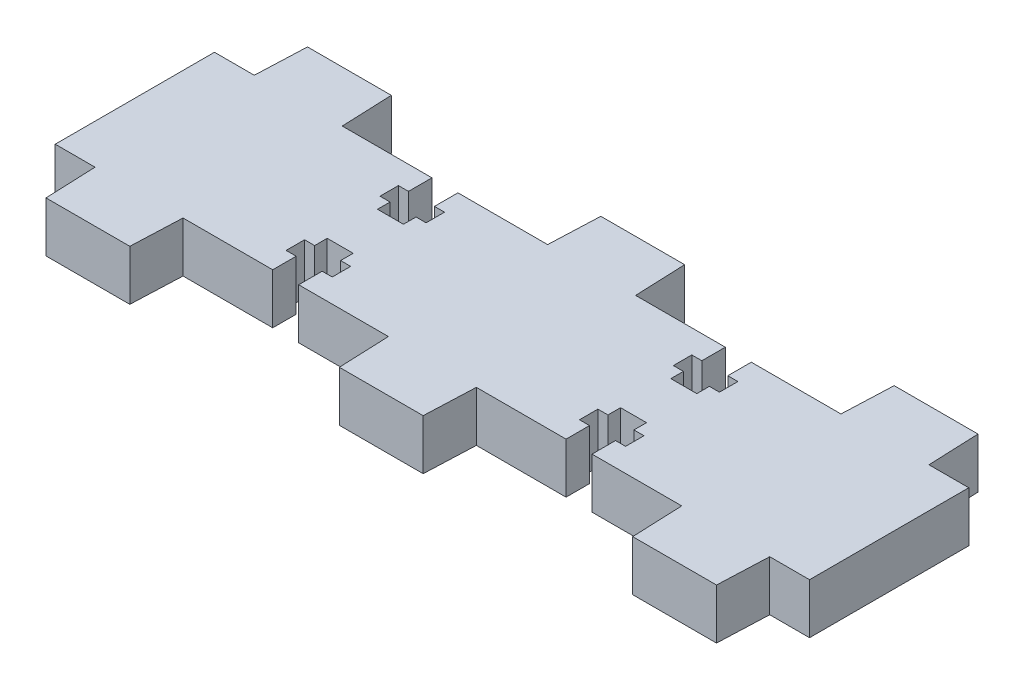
ISO-10303-21;
HEADER;
FILE_DESCRIPTION(('STEP AP214'),'2;1');
FILE_NAME('part.step','',(''),(''),'','','');
FILE_SCHEMA(('AUTOMOTIVE_DESIGN { 1 0 10303 214 1 1 1 1 }'));
ENDSEC;
DATA;
#1=APPLICATION_CONTEXT('core data for automotive mechanical design processes');
#2=APPLICATION_PROTOCOL_DEFINITION('international standard','automotive_design',2000,#1);
#3=PRODUCT_CONTEXT('',#1,'mechanical');
#4=PRODUCT('Part','Part','',(#3));
#5=PRODUCT_RELATED_PRODUCT_CATEGORY('part','',(#4));
#6=PRODUCT_DEFINITION_FORMATION('','',#4);
#7=PRODUCT_DEFINITION_CONTEXT('part definition',#1,'design');
#8=PRODUCT_DEFINITION('design','',#6,#7);
#9=PRODUCT_DEFINITION_SHAPE('','',#8);
#10=(LENGTH_UNIT() NAMED_UNIT(*) SI_UNIT(.MILLI.,.METRE.));
#11=(NAMED_UNIT(*) PLANE_ANGLE_UNIT() SI_UNIT($,.RADIAN.));
#12=(NAMED_UNIT(*) SI_UNIT($,.STERADIAN.) SOLID_ANGLE_UNIT());
#13=UNCERTAINTY_MEASURE_WITH_UNIT(LENGTH_MEASURE(1.E-05),#10,'distance_accuracy_value','');
#14=(GEOMETRIC_REPRESENTATION_CONTEXT(3) GLOBAL_UNCERTAINTY_ASSIGNED_CONTEXT((#13)) GLOBAL_UNIT_ASSIGNED_CONTEXT((#10,
#11,#12)) REPRESENTATION_CONTEXT('',''));
#15=CARTESIAN_POINT('',(0.,0.,0.));
#16=DIRECTION('',(0.,0.,1.));
#17=DIRECTION('',(1.,0.,0.));
#18=AXIS2_PLACEMENT_3D('',#15,#16,#17);
#19=CARTESIAN_POINT('',(45.,6.,-9.5));
#20=DIRECTION('',(-1.,0.,0.));
#21=DIRECTION('',(0.,0.,1.));
#22=AXIS2_PLACEMENT_3D('',#19,#20,#21);
#23=PLANE('',#22);
#24=DIRECTION('',(0.,0.,-1.));
#25=VECTOR('',#24,1.);
#26=CARTESIAN_POINT('',(45.,0.,-9.5));
#27=LINE('',#26,#25);
#28=CARTESIAN_POINT('',(45.,0.,9.5));
#29=VERTEX_POINT('',#28);
#30=CARTESIAN_POINT('',(45.,0.,-9.5));
#31=VERTEX_POINT('',#30);
#32=EDGE_CURVE('E204',#29,#31,#27,.T.);
#33=ORIENTED_EDGE('',*,*,#32,.T.);
#34=DIRECTION('',(0.,-1.,0.));
#35=VECTOR('',#34,1.);
#36=CARTESIAN_POINT('',(45.,6.,-9.5));
#37=LINE('',#36,#35);
#38=CARTESIAN_POINT('',(45.,6.,-9.5));
#39=VERTEX_POINT('',#38);
#40=EDGE_CURVE('E11',#39,#31,#37,.T.);
#41=ORIENTED_EDGE('',*,*,#40,.F.);
#42=DIRECTION('',(0.,0.,-1.));
#43=VECTOR('',#42,1.);
#44=CARTESIAN_POINT('',(45.,6.,-9.5));
#45=LINE('',#44,#43);
#46=CARTESIAN_POINT('',(45.,6.,9.5));
#47=VERTEX_POINT('',#46);
#48=EDGE_CURVE('E127',#47,#39,#45,.T.);
#49=ORIENTED_EDGE('',*,*,#48,.F.);
#50=DIRECTION('',(0.,-1.,0.));
#51=VECTOR('',#50,1.);
#52=CARTESIAN_POINT('',(45.,6.,9.5));
#53=LINE('',#52,#51);
#54=EDGE_CURVE('E431',#47,#29,#53,.T.);
#55=ORIENTED_EDGE('',*,*,#54,.T.);
#56=EDGE_LOOP('',(#33,#41,#49,#55));
#57=FACE_BOUND('',#56,.T.);
#58=ADVANCED_FACE('F34',(#57),#23,.F.);
#59=CARTESIAN_POINT('',(40.25,6.,-9.5));
#60=DIRECTION('',(0.,0.,1.));
#61=DIRECTION('',(1.,0.,0.));
#62=AXIS2_PLACEMENT_3D('',#59,#60,#61);
#63=PLANE('',#62);
#64=DIRECTION('',(-1.,0.,0.));
#65=VECTOR('',#64,1.);
#66=CARTESIAN_POINT('',(40.25,0.,-9.5));
#67=LINE('',#66,#65);
#68=CARTESIAN_POINT('',(40.25,0.,-9.5));
#69=VERTEX_POINT('',#68);
#70=EDGE_CURVE('E206',#31,#69,#67,.T.);
#71=ORIENTED_EDGE('',*,*,#70,.T.);
#72=DIRECTION('',(0.,-1.,0.));
#73=VECTOR('',#72,1.);
#74=CARTESIAN_POINT('',(40.25,6.,-9.5));
#75=LINE('',#74,#73);
#76=CARTESIAN_POINT('',(40.25,6.,-9.5));
#77=VERTEX_POINT('',#76);
#78=EDGE_CURVE('E42',#77,#69,#75,.T.);
#79=ORIENTED_EDGE('',*,*,#78,.F.);
#80=DIRECTION('',(-1.,0.,0.));
#81=VECTOR('',#80,1.);
#82=CARTESIAN_POINT('',(40.25,6.,-9.5));
#83=LINE('',#82,#81);
#84=EDGE_CURVE('E424',#39,#77,#83,.T.);
#85=ORIENTED_EDGE('',*,*,#84,.F.);
#86=ORIENTED_EDGE('',*,*,#40,.T.);
#87=EDGE_LOOP('',(#71,#79,#85,#86));
#88=FACE_BOUND('',#87,.T.);
#89=ADVANCED_FACE('F425',(#88),#63,.F.);
#90=CARTESIAN_POINT('',(40.,6.,-15.6));
#91=DIRECTION('',(-0.999161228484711,0.,0.0409492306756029));
#92=DIRECTION('',(0.0409492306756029,0.,0.999161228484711));
#93=AXIS2_PLACEMENT_3D('',#90,#91,#92);
#94=PLANE('',#93);
#95=DIRECTION('',(-0.0409492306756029,0.,-0.999161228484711));
#96=VECTOR('',#95,1.);
#97=CARTESIAN_POINT('',(40.,0.,-15.6));
#98=LINE('',#97,#96);
#99=CARTESIAN_POINT('',(40.,0.,-15.6));
#100=VERTEX_POINT('',#99);
#101=EDGE_CURVE('E209',#69,#100,#98,.T.);
#102=ORIENTED_EDGE('',*,*,#101,.T.);
#103=DIRECTION('',(0.,-1.,0.));
#104=VECTOR('',#103,1.);
#105=CARTESIAN_POINT('',(40.,6.,-15.6));
#106=LINE('',#105,#104);
#107=CARTESIAN_POINT('',(40.,6.,-15.6));
#108=VERTEX_POINT('',#107);
#109=EDGE_CURVE('E282',#108,#100,#106,.T.);
#110=ORIENTED_EDGE('',*,*,#109,.F.);
#111=DIRECTION('',(-0.0409492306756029,0.,-0.999161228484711));
#112=VECTOR('',#111,1.);
#113=CARTESIAN_POINT('',(40.,6.,-15.6));
#114=LINE('',#113,#112);
#115=EDGE_CURVE('E291',#77,#108,#114,.T.);
#116=ORIENTED_EDGE('',*,*,#115,.F.);
#117=ORIENTED_EDGE('',*,*,#78,.T.);
#118=EDGE_LOOP('',(#102,#110,#116,#117));
#119=FACE_BOUND('',#118,.T.);
#120=ADVANCED_FACE('F289',(#119),#94,.F.);
#121=CARTESIAN_POINT('',(30.,6.,-15.6));
#122=DIRECTION('',(0.,0.,1.));
#123=DIRECTION('',(1.,0.,0.));
#124=AXIS2_PLACEMENT_3D('',#121,#122,#123);
#125=PLANE('',#124);
#126=DIRECTION('',(-1.,0.,0.));
#127=VECTOR('',#126,1.);
#128=CARTESIAN_POINT('',(30.,0.,-15.6));
#129=LINE('',#128,#127);
#130=CARTESIAN_POINT('',(30.,0.,-15.6));
#131=VERTEX_POINT('',#130);
#132=EDGE_CURVE('E211',#100,#131,#129,.T.);
#133=ORIENTED_EDGE('',*,*,#132,.T.);
#134=DIRECTION('',(0.,-1.,0.));
#135=VECTOR('',#134,1.);
#136=CARTESIAN_POINT('',(30.,6.,-15.6));
#137=LINE('',#136,#135);
#138=CARTESIAN_POINT('',(30.,6.,-15.6));
#139=VERTEX_POINT('',#138);
#140=EDGE_CURVE('E279',#139,#131,#137,.T.);
#141=ORIENTED_EDGE('',*,*,#140,.F.);
#142=DIRECTION('',(-1.,0.,0.));
#143=VECTOR('',#142,1.);
#144=CARTESIAN_POINT('',(30.,6.,-15.6));
#145=LINE('',#144,#143);
#146=EDGE_CURVE('E312',#108,#139,#145,.T.);
#147=ORIENTED_EDGE('',*,*,#146,.F.);
#148=ORIENTED_EDGE('',*,*,#109,.T.);
#149=EDGE_LOOP('',(#133,#141,#147,#148));
#150=FACE_BOUND('',#149,.T.);
#151=ADVANCED_FACE('F303',(#150),#125,.F.);
#152=CARTESIAN_POINT('',(29.75,6.,-9.5));
#153=DIRECTION('',(0.999161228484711,0.,0.0409492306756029));
#154=DIRECTION('',(0.0409492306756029,0.,-0.999161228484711));
#155=AXIS2_PLACEMENT_3D('',#152,#153,#154);
#156=PLANE('',#155);
#157=DIRECTION('',(-0.0409492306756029,0.,0.999161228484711));
#158=VECTOR('',#157,1.);
#159=CARTESIAN_POINT('',(29.75,0.,-9.5));
#160=LINE('',#159,#158);
#161=CARTESIAN_POINT('',(29.75,0.,-9.5));
#162=VERTEX_POINT('',#161);
#163=EDGE_CURVE('E213',#131,#162,#160,.T.);
#164=ORIENTED_EDGE('',*,*,#163,.T.);
#165=DIRECTION('',(0.,-1.,0.));
#166=VECTOR('',#165,1.);
#167=CARTESIAN_POINT('',(29.75,6.,-9.5));
#168=LINE('',#167,#166);
#169=CARTESIAN_POINT('',(29.75,6.,-9.5));
#170=VERTEX_POINT('',#169);
#171=EDGE_CURVE('E276',#170,#162,#168,.T.);
#172=ORIENTED_EDGE('',*,*,#171,.F.);
#173=DIRECTION('',(-0.0409492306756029,0.,0.999161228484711));
#174=VECTOR('',#173,1.);
#175=CARTESIAN_POINT('',(29.75,6.,-9.5));
#176=LINE('',#175,#174);
#177=EDGE_CURVE('E309',#139,#170,#176,.T.);
#178=ORIENTED_EDGE('',*,*,#177,.F.);
#179=ORIENTED_EDGE('',*,*,#140,.T.);
#180=EDGE_LOOP('',(#164,#172,#178,#179));
#181=FACE_BOUND('',#180,.T.);
#182=ADVANCED_FACE('F307',(#181),#156,.F.);
#183=CARTESIAN_POINT('',(29.75,6.,-9.5));
#184=DIRECTION('',(0.,0.,1.));
#185=DIRECTION('',(1.,0.,0.));
#186=AXIS2_PLACEMENT_3D('',#183,#184,#185);
#187=PLANE('',#186);
#188=DIRECTION('',(-1.,0.,0.));
#189=VECTOR('',#188,1.);
#190=CARTESIAN_POINT('',(29.75,0.,-9.5));
#191=LINE('',#190,#189);
#192=CARTESIAN_POINT('',(19.05,0.,-9.5));
#193=VERTEX_POINT('',#192);
#194=EDGE_CURVE('E215',#162,#193,#191,.T.);
#195=ORIENTED_EDGE('',*,*,#194,.T.);
#196=DIRECTION('',(0.,-1.,0.));
#197=VECTOR('',#196,1.);
#198=CARTESIAN_POINT('',(19.05,6.,-9.5));
#199=LINE('',#198,#197);
#200=CARTESIAN_POINT('',(19.05,6.,-9.5));
#201=VERTEX_POINT('',#200);
#202=EDGE_CURVE('E273',#201,#193,#199,.T.);
#203=ORIENTED_EDGE('',*,*,#202,.F.);
#204=DIRECTION('',(-1.,0.,0.));
#205=VECTOR('',#204,1.);
#206=CARTESIAN_POINT('',(29.75,6.,-9.5));
#207=LINE('',#206,#205);
#208=EDGE_CURVE('E311',#170,#201,#207,.T.);
#209=ORIENTED_EDGE('',*,*,#208,.F.);
#210=ORIENTED_EDGE('',*,*,#171,.T.);
#211=EDGE_LOOP('',(#195,#203,#209,#210));
#212=FACE_BOUND('',#211,.T.);
#213=ADVANCED_FACE('F1293',(#212),#187,.F.);
#214=CARTESIAN_POINT('',(19.05,6.,-9.5));
#215=DIRECTION('',(1.,0.,0.));
#216=DIRECTION('',(0.,0.,-1.));
#217=AXIS2_PLACEMENT_3D('',#214,#215,#216);
#218=PLANE('',#217);
#219=DIRECTION('',(0.,0.,1.));
#220=VECTOR('',#219,1.);
#221=CARTESIAN_POINT('',(19.05,0.,-9.5));
#222=LINE('',#221,#220);
#223=CARTESIAN_POINT('',(19.05,0.,-6.7));
#224=VERTEX_POINT('',#223);
#225=EDGE_CURVE('E217',#193,#224,#222,.T.);
#226=ORIENTED_EDGE('',*,*,#225,.T.);
#227=DIRECTION('',(0.,-1.,0.));
#228=VECTOR('',#227,1.);
#229=CARTESIAN_POINT('',(19.05,6.,-6.7));
#230=LINE('',#229,#228);
#231=CARTESIAN_POINT('',(19.05,6.,-6.7));
#232=VERTEX_POINT('',#231);
#233=EDGE_CURVE('E270',#232,#224,#230,.T.);
#234=ORIENTED_EDGE('',*,*,#233,.F.);
#235=DIRECTION('',(0.,0.,1.));
#236=VECTOR('',#235,1.);
#237=CARTESIAN_POINT('',(19.05,6.,-9.5));
#238=LINE('',#237,#236);
#239=EDGE_CURVE('E314',#201,#232,#238,.T.);
#240=ORIENTED_EDGE('',*,*,#239,.F.);
#241=ORIENTED_EDGE('',*,*,#202,.T.);
#242=EDGE_LOOP('',(#226,#234,#240,#241));
#243=FACE_BOUND('',#242,.T.);
#244=ADVANCED_FACE('F1296',(#243),#218,.F.);
#245=CARTESIAN_POINT('',(19.05,6.,-6.7));
#246=DIRECTION('',(0.,0.,-1.));
#247=DIRECTION('',(-1.,0.,0.));
#248=AXIS2_PLACEMENT_3D('',#245,#246,#247);
#249=PLANE('',#248);
#250=DIRECTION('',(1.,0.,0.));
#251=VECTOR('',#250,1.);
#252=CARTESIAN_POINT('',(19.05,0.,-6.7));
#253=LINE('',#252,#251);
#254=CARTESIAN_POINT('',(20.25,0.,-6.7));
#255=VERTEX_POINT('',#254);
#256=EDGE_CURVE('E219',#224,#255,#253,.T.);
#257=ORIENTED_EDGE('',*,*,#256,.T.);
#258=DIRECTION('',(0.,-1.,0.));
#259=VECTOR('',#258,1.);
#260=CARTESIAN_POINT('',(20.25,6.,-6.7));
#261=LINE('',#260,#259);
#262=CARTESIAN_POINT('',(20.25,6.,-6.7));
#263=VERTEX_POINT('',#262);
#264=EDGE_CURVE('E267',#263,#255,#261,.T.);
#265=ORIENTED_EDGE('',*,*,#264,.F.);
#266=DIRECTION('',(1.,0.,0.));
#267=VECTOR('',#266,1.);
#268=CARTESIAN_POINT('',(19.05,6.,-6.7));
#269=LINE('',#268,#267);
#270=EDGE_CURVE('E320',#232,#263,#269,.T.);
#271=ORIENTED_EDGE('',*,*,#270,.F.);
#272=ORIENTED_EDGE('',*,*,#233,.T.);
#273=EDGE_LOOP('',(#257,#265,#271,#272));
#274=FACE_BOUND('',#273,.T.);
#275=ADVANCED_FACE('F1300',(#274),#249,.F.);
#276=CARTESIAN_POINT('',(20.25,6.,-6.7));
#277=DIRECTION('',(1.,0.,0.));
#278=DIRECTION('',(0.,0.,-1.));
#279=AXIS2_PLACEMENT_3D('',#276,#277,#278);
#280=PLANE('',#279);
#281=DIRECTION('',(0.,0.,1.));
#282=VECTOR('',#281,1.);
#283=CARTESIAN_POINT('',(20.25,0.,-6.7));
#284=LINE('',#283,#282);
#285=CARTESIAN_POINT('',(20.25,0.,-4.5));
#286=VERTEX_POINT('',#285);
#287=EDGE_CURVE('E221',#255,#286,#284,.T.);
#288=ORIENTED_EDGE('',*,*,#287,.T.);
#289=DIRECTION('',(0.,-1.,0.));
#290=VECTOR('',#289,1.);
#291=CARTESIAN_POINT('',(20.25,6.,-4.5));
#292=LINE('',#291,#290);
#293=CARTESIAN_POINT('',(20.25,6.,-4.5));
#294=VERTEX_POINT('',#293);
#295=EDGE_CURVE('E264',#294,#286,#292,.T.);
#296=ORIENTED_EDGE('',*,*,#295,.F.);
#297=DIRECTION('',(0.,0.,1.));
#298=VECTOR('',#297,1.);
#299=CARTESIAN_POINT('',(20.25,6.,-6.7));
#300=LINE('',#299,#298);
#301=EDGE_CURVE('E322',#263,#294,#300,.T.);
#302=ORIENTED_EDGE('',*,*,#301,.F.);
#303=ORIENTED_EDGE('',*,*,#264,.T.);
#304=EDGE_LOOP('',(#288,#296,#302,#303));
#305=FACE_BOUND('',#304,.T.);
#306=ADVANCED_FACE('F1304',(#305),#280,.F.);
#307=CARTESIAN_POINT('',(20.25,6.,-4.5));
#308=DIRECTION('',(0.,0.,1.));
#309=DIRECTION('',(1.,0.,0.));
#310=AXIS2_PLACEMENT_3D('',#307,#308,#309);
#311=PLANE('',#310);
#312=DIRECTION('',(-1.,0.,0.));
#313=VECTOR('',#312,1.);
#314=CARTESIAN_POINT('',(20.25,0.,-4.5));
#315=LINE('',#314,#313);
#316=CARTESIAN_POINT('',(19.05,0.,-4.5));
#317=VERTEX_POINT('',#316);
#318=EDGE_CURVE('E223',#286,#317,#315,.T.);
#319=ORIENTED_EDGE('',*,*,#318,.T.);
#320=DIRECTION('',(0.,-1.,0.));
#321=VECTOR('',#320,1.);
#322=CARTESIAN_POINT('',(19.05,6.,-4.5));
#323=LINE('',#322,#321);
#324=CARTESIAN_POINT('',(19.05,6.,-4.5));
#325=VERTEX_POINT('',#324);
#326=EDGE_CURVE('E261',#325,#317,#323,.T.);
#327=ORIENTED_EDGE('',*,*,#326,.F.);
#328=DIRECTION('',(-1.,0.,0.));
#329=VECTOR('',#328,1.);
#330=CARTESIAN_POINT('',(20.25,6.,-4.5));
#331=LINE('',#330,#329);
#332=EDGE_CURVE('E324',#294,#325,#331,.T.);
#333=ORIENTED_EDGE('',*,*,#332,.F.);
#334=ORIENTED_EDGE('',*,*,#295,.T.);
#335=EDGE_LOOP('',(#319,#327,#333,#334));
#336=FACE_BOUND('',#335,.T.);
#337=ADVANCED_FACE('F1308',(#336),#311,.F.);
#338=CARTESIAN_POINT('',(19.05,6.,-4.5));
#339=DIRECTION('',(1.,0.,0.));
#340=DIRECTION('',(0.,0.,-1.));
#341=AXIS2_PLACEMENT_3D('',#338,#339,#340);
#342=PLANE('',#341);
#343=DIRECTION('',(0.,0.,1.));
#344=VECTOR('',#343,1.);
#345=CARTESIAN_POINT('',(19.05,0.,-4.5));
#346=LINE('',#345,#344);
#347=CARTESIAN_POINT('',(19.05,0.,-3.));
#348=VERTEX_POINT('',#347);
#349=EDGE_CURVE('E225',#317,#348,#346,.T.);
#350=ORIENTED_EDGE('',*,*,#349,.T.);
#351=DIRECTION('',(0.,-1.,0.));
#352=VECTOR('',#351,1.);
#353=CARTESIAN_POINT('',(19.05,6.,-3.));
#354=LINE('',#353,#352);
#355=CARTESIAN_POINT('',(19.05,6.,-3.));
#356=VERTEX_POINT('',#355);
#357=EDGE_CURVE('E258',#356,#348,#354,.T.);
#358=ORIENTED_EDGE('',*,*,#357,.F.);
#359=DIRECTION('',(0.,0.,1.));
#360=VECTOR('',#359,1.);
#361=CARTESIAN_POINT('',(19.05,6.,-4.5));
#362=LINE('',#361,#360);
#363=EDGE_CURVE('E326',#325,#356,#362,.T.);
#364=ORIENTED_EDGE('',*,*,#363,.F.);
#365=ORIENTED_EDGE('',*,*,#326,.T.);
#366=EDGE_LOOP('',(#350,#358,#364,#365));
#367=FACE_BOUND('',#366,.T.);
#368=ADVANCED_FACE('F1312',(#367),#342,.F.);
#369=CARTESIAN_POINT('',(15.95,6.,-3.));
#370=DIRECTION('',(0.,0.,1.));
#371=DIRECTION('',(1.,0.,0.));
#372=AXIS2_PLACEMENT_3D('',#369,#370,#371);
#373=PLANE('',#372);
#374=DIRECTION('',(-1.,0.,0.));
#375=VECTOR('',#374,1.);
#376=CARTESIAN_POINT('',(15.95,0.,-3.));
#377=LINE('',#376,#375);
#378=CARTESIAN_POINT('',(15.95,0.,-3.));
#379=VERTEX_POINT('',#378);
#380=EDGE_CURVE('E227',#348,#379,#377,.T.);
#381=ORIENTED_EDGE('',*,*,#380,.T.);
#382=DIRECTION('',(0.,-1.,0.));
#383=VECTOR('',#382,1.);
#384=CARTESIAN_POINT('',(15.95,6.,-3.));
#385=LINE('',#384,#383);
#386=CARTESIAN_POINT('',(15.95,6.,-3.));
#387=VERTEX_POINT('',#386);
#388=EDGE_CURVE('E255',#387,#379,#385,.T.);
#389=ORIENTED_EDGE('',*,*,#388,.F.);
#390=DIRECTION('',(-1.,0.,0.));
#391=VECTOR('',#390,1.);
#392=CARTESIAN_POINT('',(15.95,6.,-3.));
#393=LINE('',#392,#391);
#394=EDGE_CURVE('E328',#356,#387,#393,.T.);
#395=ORIENTED_EDGE('',*,*,#394,.F.);
#396=ORIENTED_EDGE('',*,*,#357,.T.);
#397=EDGE_LOOP('',(#381,#389,#395,#396));
#398=FACE_BOUND('',#397,.T.);
#399=ADVANCED_FACE('F1316',(#398),#373,.F.);
#400=CARTESIAN_POINT('',(15.95,6.,-4.5));
#401=DIRECTION('',(-1.,0.,0.));
#402=DIRECTION('',(0.,0.,1.));
#403=AXIS2_PLACEMENT_3D('',#400,#401,#402);
#404=PLANE('',#403);
#405=DIRECTION('',(0.,0.,-1.));
#406=VECTOR('',#405,1.);
#407=CARTESIAN_POINT('',(15.95,0.,-4.5));
#408=LINE('',#407,#406);
#409=CARTESIAN_POINT('',(15.95,0.,-4.5));
#410=VERTEX_POINT('',#409);
#411=EDGE_CURVE('E229',#379,#410,#408,.T.);
#412=ORIENTED_EDGE('',*,*,#411,.T.);
#413=DIRECTION('',(0.,-1.,0.));
#414=VECTOR('',#413,1.);
#415=CARTESIAN_POINT('',(15.95,6.,-4.5));
#416=LINE('',#415,#414);
#417=CARTESIAN_POINT('',(15.95,6.,-4.5));
#418=VERTEX_POINT('',#417);
#419=EDGE_CURVE('E252',#418,#410,#416,.T.);
#420=ORIENTED_EDGE('',*,*,#419,.F.);
#421=DIRECTION('',(0.,0.,-1.));
#422=VECTOR('',#421,1.);
#423=CARTESIAN_POINT('',(15.95,6.,-4.5));
#424=LINE('',#423,#422);
#425=EDGE_CURVE('E330',#387,#418,#424,.T.);
#426=ORIENTED_EDGE('',*,*,#425,.F.);
#427=ORIENTED_EDGE('',*,*,#388,.T.);
#428=EDGE_LOOP('',(#412,#420,#426,#427));
#429=FACE_BOUND('',#428,.T.);
#430=ADVANCED_FACE('F1320',(#429),#404,.F.);
#431=CARTESIAN_POINT('',(14.75,6.,-4.5));
#432=DIRECTION('',(0.,0.,1.));
#433=DIRECTION('',(1.,0.,0.));
#434=AXIS2_PLACEMENT_3D('',#431,#432,#433);
#435=PLANE('',#434);
#436=DIRECTION('',(-1.,0.,0.));
#437=VECTOR('',#436,1.);
#438=CARTESIAN_POINT('',(14.75,0.,-4.5));
#439=LINE('',#438,#437);
#440=CARTESIAN_POINT('',(14.75,0.,-4.5));
#441=VERTEX_POINT('',#440);
#442=EDGE_CURVE('E231',#410,#441,#439,.T.);
#443=ORIENTED_EDGE('',*,*,#442,.T.);
#444=DIRECTION('',(0.,-1.,0.));
#445=VECTOR('',#444,1.);
#446=CARTESIAN_POINT('',(14.75,6.,-4.5));
#447=LINE('',#446,#445);
#448=CARTESIAN_POINT('',(14.75,6.,-4.5));
#449=VERTEX_POINT('',#448);
#450=EDGE_CURVE('E249',#449,#441,#447,.T.);
#451=ORIENTED_EDGE('',*,*,#450,.F.);
#452=DIRECTION('',(-1.,0.,0.));
#453=VECTOR('',#452,1.);
#454=CARTESIAN_POINT('',(14.75,6.,-4.5));
#455=LINE('',#454,#453);
#456=EDGE_CURVE('E332',#418,#449,#455,.T.);
#457=ORIENTED_EDGE('',*,*,#456,.F.);
#458=ORIENTED_EDGE('',*,*,#419,.T.);
#459=EDGE_LOOP('',(#443,#451,#457,#458));
#460=FACE_BOUND('',#459,.T.);
#461=ADVANCED_FACE('F1324',(#460),#435,.F.);
#462=CARTESIAN_POINT('',(14.75,6.,-6.7));
#463=DIRECTION('',(-1.,0.,0.));
#464=DIRECTION('',(0.,0.,1.));
#465=AXIS2_PLACEMENT_3D('',#462,#463,#464);
#466=PLANE('',#465);
#467=DIRECTION('',(0.,0.,-1.));
#468=VECTOR('',#467,1.);
#469=CARTESIAN_POINT('',(14.75,0.,-6.7));
#470=LINE('',#469,#468);
#471=CARTESIAN_POINT('',(14.75,0.,-6.7));
#472=VERTEX_POINT('',#471);
#473=EDGE_CURVE('E233',#441,#472,#470,.T.);
#474=ORIENTED_EDGE('',*,*,#473,.T.);
#475=DIRECTION('',(0.,-1.,0.));
#476=VECTOR('',#475,1.);
#477=CARTESIAN_POINT('',(14.75,6.,-6.7));
#478=LINE('',#477,#476);
#479=CARTESIAN_POINT('',(14.75,6.,-6.7));
#480=VERTEX_POINT('',#479);
#481=EDGE_CURVE('E246',#480,#472,#478,.T.);
#482=ORIENTED_EDGE('',*,*,#481,.F.);
#483=DIRECTION('',(0.,0.,-1.));
#484=VECTOR('',#483,1.);
#485=CARTESIAN_POINT('',(14.75,6.,-6.7));
#486=LINE('',#485,#484);
#487=EDGE_CURVE('E334',#449,#480,#486,.T.);
#488=ORIENTED_EDGE('',*,*,#487,.F.);
#489=ORIENTED_EDGE('',*,*,#450,.T.);
#490=EDGE_LOOP('',(#474,#482,#488,#489));
#491=FACE_BOUND('',#490,.T.);
#492=ADVANCED_FACE('F340',(#491),#466,.F.);
#493=CARTESIAN_POINT('',(15.95,6.,-6.7));
#494=DIRECTION('',(0.,0.,-1.));
#495=DIRECTION('',(-1.,0.,0.));
#496=AXIS2_PLACEMENT_3D('',#493,#494,#495);
#497=PLANE('',#496);
#498=DIRECTION('',(1.,0.,0.));
#499=VECTOR('',#498,1.);
#500=CARTESIAN_POINT('',(15.95,0.,-6.7));
#501=LINE('',#500,#499);
#502=CARTESIAN_POINT('',(15.95,0.,-6.7));
#503=VERTEX_POINT('',#502);
#504=EDGE_CURVE('E235',#472,#503,#501,.T.);
#505=ORIENTED_EDGE('',*,*,#504,.T.);
#506=DIRECTION('',(0.,-1.,0.));
#507=VECTOR('',#506,1.);
#508=CARTESIAN_POINT('',(15.95,6.,-6.7));
#509=LINE('',#508,#507);
#510=CARTESIAN_POINT('',(15.95,6.,-6.7));
#511=VERTEX_POINT('',#510);
#512=EDGE_CURVE('E193',#511,#503,#509,.T.);
#513=ORIENTED_EDGE('',*,*,#512,.F.);
#514=DIRECTION('',(1.,0.,0.));
#515=VECTOR('',#514,1.);
#516=CARTESIAN_POINT('',(15.95,6.,-6.7));
#517=LINE('',#516,#515);
#518=EDGE_CURVE('E184',#480,#511,#517,.T.);
#519=ORIENTED_EDGE('',*,*,#518,.F.);
#520=ORIENTED_EDGE('',*,*,#481,.T.);
#521=EDGE_LOOP('',(#505,#513,#519,#520));
#522=FACE_BOUND('',#521,.T.);
#523=ADVANCED_FACE('F344',(#522),#497,.F.);
#524=CARTESIAN_POINT('',(15.95,6.,-9.5));
#525=DIRECTION('',(-1.,0.,0.));
#526=DIRECTION('',(0.,0.,1.));
#527=AXIS2_PLACEMENT_3D('',#524,#525,#526);
#528=PLANE('',#527);
#529=DIRECTION('',(0.,0.,-1.));
#530=VECTOR('',#529,1.);
#531=CARTESIAN_POINT('',(15.95,0.,-9.5));
#532=LINE('',#531,#530);
#533=CARTESIAN_POINT('',(15.95,0.,-9.5));
#534=VERTEX_POINT('',#533);
#535=EDGE_CURVE('E192',#503,#534,#532,.T.);
#536=ORIENTED_EDGE('',*,*,#535,.T.);
#537=DIRECTION('',(0.,-1.,0.));
#538=VECTOR('',#537,1.);
#539=CARTESIAN_POINT('',(15.95,6.,-9.5));
#540=LINE('',#539,#538);
#541=CARTESIAN_POINT('',(15.95,6.,-9.5));
#542=VERTEX_POINT('',#541);
#543=EDGE_CURVE('E189',#542,#534,#540,.T.);
#544=ORIENTED_EDGE('',*,*,#543,.F.);
#545=DIRECTION('',(0.,0.,-1.));
#546=VECTOR('',#545,1.);
#547=CARTESIAN_POINT('',(15.95,6.,-9.5));
#548=LINE('',#547,#546);
#549=EDGE_CURVE('E177',#511,#542,#548,.T.);
#550=ORIENTED_EDGE('',*,*,#549,.F.);
#551=ORIENTED_EDGE('',*,*,#512,.T.);
#552=EDGE_LOOP('',(#536,#544,#550,#551));
#553=FACE_BOUND('',#552,.T.);
#554=ADVANCED_FACE('F190',(#553),#528,.F.);
#555=CARTESIAN_POINT('',(5.25,6.,-9.5));
#556=DIRECTION('',(0.,0.,1.));
#557=DIRECTION('',(1.,0.,0.));
#558=AXIS2_PLACEMENT_3D('',#555,#556,#557);
#559=PLANE('',#558);
#560=DIRECTION('',(-1.,0.,0.));
#561=VECTOR('',#560,1.);
#562=CARTESIAN_POINT('',(5.25,0.,-9.5));
#563=LINE('',#562,#561);
#564=CARTESIAN_POINT('',(5.25,0.,-9.5));
#565=VERTEX_POINT('',#564);
#566=EDGE_CURVE('E113',#534,#565,#563,.T.);
#567=ORIENTED_EDGE('',*,*,#566,.T.);
#568=DIRECTION('',(0.,-1.,0.));
#569=VECTOR('',#568,1.);
#570=CARTESIAN_POINT('',(5.25,6.,-9.5));
#571=LINE('',#570,#569);
#572=CARTESIAN_POINT('',(5.25,6.,-9.5));
#573=VERTEX_POINT('',#572);
#574=EDGE_CURVE('E194',#573,#565,#571,.T.);
#575=ORIENTED_EDGE('',*,*,#574,.F.);
#576=DIRECTION('',(-1.,0.,0.));
#577=VECTOR('',#576,1.);
#578=CARTESIAN_POINT('',(5.25,6.,-9.5));
#579=LINE('',#578,#577);
#580=EDGE_CURVE('E182',#542,#573,#579,.T.);
#581=ORIENTED_EDGE('',*,*,#580,.F.);
#582=ORIENTED_EDGE('',*,*,#543,.T.);
#583=EDGE_LOOP('',(#567,#575,#581,#582));
#584=FACE_BOUND('',#583,.T.);
#585=ADVANCED_FACE('F196',(#584),#559,.F.);
#586=CARTESIAN_POINT('',(5.,6.,-15.6));
#587=DIRECTION('',(-0.999161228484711,0.,0.0409492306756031));
#588=DIRECTION('',(0.0409492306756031,0.,0.999161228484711));
#589=AXIS2_PLACEMENT_3D('',#586,#587,#588);
#590=PLANE('',#589);
#591=DIRECTION('',(-0.0409492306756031,0.,-0.999161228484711));
#592=VECTOR('',#591,1.);
#593=CARTESIAN_POINT('',(5.,0.,-15.6));
#594=LINE('',#593,#592);
#595=CARTESIAN_POINT('',(5.,0.,-15.6));
#596=VERTEX_POINT('',#595);
#597=EDGE_CURVE('E119',#565,#596,#594,.T.);
#598=ORIENTED_EDGE('',*,*,#597,.T.);
#599=DIRECTION('',(0.,-1.,0.));
#600=VECTOR('',#599,1.);
#601=CARTESIAN_POINT('',(5.,6.,-15.6));
#602=LINE('',#601,#600);
#603=CARTESIAN_POINT('',(5.,6.,-15.6));
#604=VERTEX_POINT('',#603);
#605=EDGE_CURVE('E203',#604,#596,#602,.T.);
#606=ORIENTED_EDGE('',*,*,#605,.F.);
#607=DIRECTION('',(-0.0409492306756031,0.,-0.999161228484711));
#608=VECTOR('',#607,1.);
#609=CARTESIAN_POINT('',(5.,6.,-15.6));
#610=LINE('',#609,#608);
#611=EDGE_CURVE('E50',#573,#604,#610,.T.);
#612=ORIENTED_EDGE('',*,*,#611,.F.);
#613=ORIENTED_EDGE('',*,*,#574,.T.);
#614=EDGE_LOOP('',(#598,#606,#612,#613));
#615=FACE_BOUND('',#614,.T.);
#616=ADVANCED_FACE('F1337',(#615),#590,.F.);
#617=CARTESIAN_POINT('',(0.,6.,-15.6));
#618=DIRECTION('',(0.,0.,1.));
#619=DIRECTION('',(1.,0.,0.));
#620=AXIS2_PLACEMENT_3D('',#617,#618,#619);
#621=PLANE('',#620);
#622=DIRECTION('',(-1.,0.,0.));
#623=VECTOR('',#622,1.);
#624=CARTESIAN_POINT('',(0.,0.,-15.6));
#625=LINE('',#624,#623);
#626=CARTESIAN_POINT('',(-5.,0.,-15.6));
#627=VERTEX_POINT('',#626);
#628=EDGE_CURVE('E240',#596,#627,#625,.T.);
#629=ORIENTED_EDGE('',*,*,#628,.T.);
#630=DIRECTION('',(0.,-1.,0.));
#631=VECTOR('',#630,1.);
#632=CARTESIAN_POINT('',(-5.,6.,-15.6));
#633=LINE('',#632,#631);
#634=CARTESIAN_POINT('',(-5.,6.,-15.6));
#635=VERTEX_POINT('',#634);
#636=EDGE_CURVE('E355',#635,#627,#633,.T.);
#637=ORIENTED_EDGE('',*,*,#636,.F.);
#638=DIRECTION('',(-1.,0.,0.));
#639=VECTOR('',#638,1.);
#640=CARTESIAN_POINT('',(0.,6.,-15.6));
#641=LINE('',#640,#639);
#642=EDGE_CURVE('E198',#604,#635,#641,.T.);
#643=ORIENTED_EDGE('',*,*,#642,.F.);
#644=ORIENTED_EDGE('',*,*,#605,.T.);
#645=EDGE_LOOP('',(#629,#637,#643,#644));
#646=FACE_BOUND('',#645,.T.);
#647=ADVANCED_FACE('F353',(#646),#621,.F.);
#648=CARTESIAN_POINT('',(0.,6.,0.));
#649=DIRECTION('',(0.,-1.,0.));
#650=DIRECTION('',(0.,0.,-1.));
#651=AXIS2_PLACEMENT_3D('',#648,#649,#650);
#652=PLANE('',#651);
#653=DIRECTION('',(0.,0.,-1.));
#654=VECTOR('',#653,1.);
#655=CARTESIAN_POINT('',(-45.,6.,-9.50000000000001));
#656=LINE('',#655,#654);
#657=CARTESIAN_POINT('',(-45.,6.,9.50000000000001));
#658=VERTEX_POINT('',#657);
#659=CARTESIAN_POINT('',(-45.,6.,-9.50000000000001));
#660=VERTEX_POINT('',#659);
#661=EDGE_CURVE('E562',#658,#660,#656,.T.);
#662=ORIENTED_EDGE('',*,*,#661,.F.);
#663=DIRECTION('',(1.,0.,0.));
#664=VECTOR('',#663,1.);
#665=CARTESIAN_POINT('',(-40.25,6.,9.50000000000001));
#666=LINE('',#665,#664);
#667=CARTESIAN_POINT('',(-40.25,6.,9.50000000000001));
#668=VERTEX_POINT('',#667);
#669=EDGE_CURVE('E1012',#658,#668,#666,.T.);
#670=ORIENTED_EDGE('',*,*,#669,.T.);
#671=DIRECTION('',(0.0409492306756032,0.,0.999161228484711));
#672=VECTOR('',#671,1.);
#673=CARTESIAN_POINT('',(-40.,6.,15.6));
#674=LINE('',#673,#672);
#675=CARTESIAN_POINT('',(-40.,6.,15.6));
#676=VERTEX_POINT('',#675);
#677=EDGE_CURVE('E1021',#668,#676,#674,.T.);
#678=ORIENTED_EDGE('',*,*,#677,.T.);
#679=DIRECTION('',(1.,0.,0.));
#680=VECTOR('',#679,1.);
#681=CARTESIAN_POINT('',(-30.,6.,15.6));
#682=LINE('',#681,#680);
#683=CARTESIAN_POINT('',(-30.,6.,15.6));
#684=VERTEX_POINT('',#683);
#685=EDGE_CURVE('E1024',#676,#684,#682,.T.);
#686=ORIENTED_EDGE('',*,*,#685,.T.);
#687=DIRECTION('',(0.0409492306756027,0.,-0.999161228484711));
#688=VECTOR('',#687,1.);
#689=CARTESIAN_POINT('',(-29.75,6.,9.50000000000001));
#690=LINE('',#689,#688);
#691=CARTESIAN_POINT('',(-29.75,6.,9.50000000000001));
#692=VERTEX_POINT('',#691);
#693=EDGE_CURVE('E1031',#684,#692,#690,.T.);
#694=ORIENTED_EDGE('',*,*,#693,.T.);
#695=DIRECTION('',(1.,0.,0.));
#696=VECTOR('',#695,1.);
#697=CARTESIAN_POINT('',(-29.75,6.,9.50000000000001));
#698=LINE('',#697,#696);
#699=CARTESIAN_POINT('',(-19.05,6.,9.50000000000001));
#700=VERTEX_POINT('',#699);
#701=EDGE_CURVE('E1034',#692,#700,#698,.T.);
#702=ORIENTED_EDGE('',*,*,#701,.T.);
#703=DIRECTION('',(0.,0.,-1.));
#704=VECTOR('',#703,1.);
#705=CARTESIAN_POINT('',(-19.05,6.,9.50000000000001));
#706=LINE('',#705,#704);
#707=CARTESIAN_POINT('',(-19.05,6.,6.70000000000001));
#708=VERTEX_POINT('',#707);
#709=EDGE_CURVE('E1037',#700,#708,#706,.T.);
#710=ORIENTED_EDGE('',*,*,#709,.T.);
#711=DIRECTION('',(-1.,0.,0.));
#712=VECTOR('',#711,1.);
#713=CARTESIAN_POINT('',(-19.05,6.,6.70000000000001));
#714=LINE('',#713,#712);
#715=CARTESIAN_POINT('',(-20.25,6.,6.70000000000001));
#716=VERTEX_POINT('',#715);
#717=EDGE_CURVE('E1040',#708,#716,#714,.T.);
#718=ORIENTED_EDGE('',*,*,#717,.T.);
#719=DIRECTION('',(0.,0.,-1.));
#720=VECTOR('',#719,1.);
#721=CARTESIAN_POINT('',(-20.25,6.,6.70000000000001));
#722=LINE('',#721,#720);
#723=CARTESIAN_POINT('',(-20.25,6.,4.50000000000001));
#724=VERTEX_POINT('',#723);
#725=EDGE_CURVE('E1043',#716,#724,#722,.T.);
#726=ORIENTED_EDGE('',*,*,#725,.T.);
#727=DIRECTION('',(1.,0.,0.));
#728=VECTOR('',#727,1.);
#729=CARTESIAN_POINT('',(-20.25,6.,4.50000000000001));
#730=LINE('',#729,#728);
#731=CARTESIAN_POINT('',(-19.05,6.,4.50000000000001));
#732=VERTEX_POINT('',#731);
#733=EDGE_CURVE('E1046',#724,#732,#730,.T.);
#734=ORIENTED_EDGE('',*,*,#733,.T.);
#735=DIRECTION('',(0.,0.,-1.));
#736=VECTOR('',#735,1.);
#737=CARTESIAN_POINT('',(-19.05,6.,4.50000000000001));
#738=LINE('',#737,#736);
#739=CARTESIAN_POINT('',(-19.05,6.,3.));
#740=VERTEX_POINT('',#739);
#741=EDGE_CURVE('E1049',#732,#740,#738,.T.);
#742=ORIENTED_EDGE('',*,*,#741,.T.);
#743=DIRECTION('',(1.,0.,0.));
#744=VECTOR('',#743,1.);
#745=CARTESIAN_POINT('',(-15.95,6.,3.));
#746=LINE('',#745,#744);
#747=CARTESIAN_POINT('',(-15.95,6.,3.));
#748=VERTEX_POINT('',#747);
#749=EDGE_CURVE('E1052',#740,#748,#746,.T.);
#750=ORIENTED_EDGE('',*,*,#749,.T.);
#751=DIRECTION('',(0.,0.,1.));
#752=VECTOR('',#751,1.);
#753=CARTESIAN_POINT('',(-15.95,6.,4.5));
#754=LINE('',#753,#752);
#755=CARTESIAN_POINT('',(-15.95,6.,4.5));
#756=VERTEX_POINT('',#755);
#757=EDGE_CURVE('E1055',#748,#756,#754,.T.);
#758=ORIENTED_EDGE('',*,*,#757,.T.);
#759=DIRECTION('',(1.,0.,0.));
#760=VECTOR('',#759,1.);
#761=CARTESIAN_POINT('',(-14.75,6.,4.5));
#762=LINE('',#761,#760);
#763=CARTESIAN_POINT('',(-14.75,6.,4.5));
#764=VERTEX_POINT('',#763);
#765=EDGE_CURVE('E1058',#756,#764,#762,.T.);
#766=ORIENTED_EDGE('',*,*,#765,.T.);
#767=DIRECTION('',(0.,0.,1.));
#768=VECTOR('',#767,1.);
#769=CARTESIAN_POINT('',(-14.75,6.,6.7));
#770=LINE('',#769,#768);
#771=CARTESIAN_POINT('',(-14.75,6.,6.7));
#772=VERTEX_POINT('',#771);
#773=EDGE_CURVE('E1061',#764,#772,#770,.T.);
#774=ORIENTED_EDGE('',*,*,#773,.T.);
#775=DIRECTION('',(-1.,0.,0.));
#776=VECTOR('',#775,1.);
#777=CARTESIAN_POINT('',(-15.95,6.,6.70000000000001));
#778=LINE('',#777,#776);
#779=CARTESIAN_POINT('',(-15.95,6.,6.70000000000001));
#780=VERTEX_POINT('',#779);
#781=EDGE_CURVE('E1064',#772,#780,#778,.T.);
#782=ORIENTED_EDGE('',*,*,#781,.T.);
#783=DIRECTION('',(0.,0.,1.));
#784=VECTOR('',#783,1.);
#785=CARTESIAN_POINT('',(-15.95,6.,9.5));
#786=LINE('',#785,#784);
#787=CARTESIAN_POINT('',(-15.95,6.,9.5));
#788=VERTEX_POINT('',#787);
#789=EDGE_CURVE('E1067',#780,#788,#786,.T.);
#790=ORIENTED_EDGE('',*,*,#789,.T.);
#791=DIRECTION('',(1.,0.,0.));
#792=VECTOR('',#791,1.);
#793=CARTESIAN_POINT('',(-5.25,6.,9.5));
#794=LINE('',#793,#792);
#795=CARTESIAN_POINT('',(-5.25,6.,9.5));
#796=VERTEX_POINT('',#795);
#797=EDGE_CURVE('E1070',#788,#796,#794,.T.);
#798=ORIENTED_EDGE('',*,*,#797,.T.);
#799=DIRECTION('',(0.0409492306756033,0.,0.999161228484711));
#800=VECTOR('',#799,1.);
#801=CARTESIAN_POINT('',(-5.,6.,15.6));
#802=LINE('',#801,#800);
#803=CARTESIAN_POINT('',(-5.,6.,15.6));
#804=VERTEX_POINT('',#803);
#805=EDGE_CURVE('E1073',#796,#804,#802,.T.);
#806=ORIENTED_EDGE('',*,*,#805,.T.);
#807=DIRECTION('',(-1.,0.,0.));
#808=VECTOR('',#807,1.);
#809=CARTESIAN_POINT('',(0.,6.,15.6));
#810=LINE('',#809,#808);
#811=CARTESIAN_POINT('',(5.,6.,15.6));
#812=VERTEX_POINT('',#811);
#813=EDGE_CURVE('E454',#812,#804,#810,.T.);
#814=ORIENTED_EDGE('',*,*,#813,.F.);
#815=DIRECTION('',(-0.0409492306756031,0.,0.999161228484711));
#816=VECTOR('',#815,1.);
#817=CARTESIAN_POINT('',(5.,6.,15.6));
#818=LINE('',#817,#816);
#819=CARTESIAN_POINT('',(5.25,6.,9.5));
#820=VERTEX_POINT('',#819);
#821=EDGE_CURVE('E1208',#820,#812,#818,.T.);
#822=ORIENTED_EDGE('',*,*,#821,.F.);
#823=DIRECTION('',(-1.,0.,0.));
#824=VECTOR('',#823,1.);
#825=CARTESIAN_POINT('',(5.25,6.,9.5));
#826=LINE('',#825,#824);
#827=CARTESIAN_POINT('',(15.95,6.,9.5));
#828=VERTEX_POINT('',#827);
#829=EDGE_CURVE('E1206',#828,#820,#826,.T.);
#830=ORIENTED_EDGE('',*,*,#829,.F.);
#831=DIRECTION('',(0.,0.,1.));
#832=VECTOR('',#831,1.);
#833=CARTESIAN_POINT('',(15.95,6.,9.5));
#834=LINE('',#833,#832);
#835=CARTESIAN_POINT('',(15.95,6.,6.7));
#836=VERTEX_POINT('',#835);
#837=EDGE_CURVE('E1203',#836,#828,#834,.T.);
#838=ORIENTED_EDGE('',*,*,#837,.F.);
#839=DIRECTION('',(1.,0.,0.));
#840=VECTOR('',#839,1.);
#841=CARTESIAN_POINT('',(15.95,6.,6.7));
#842=LINE('',#841,#840);
#843=CARTESIAN_POINT('',(14.75,6.,6.7));
#844=VERTEX_POINT('',#843);
#845=EDGE_CURVE('E1200',#844,#836,#842,.T.);
#846=ORIENTED_EDGE('',*,*,#845,.F.);
#847=DIRECTION('',(0.,0.,1.));
#848=VECTOR('',#847,1.);
#849=CARTESIAN_POINT('',(14.75,6.,6.7));
#850=LINE('',#849,#848);
#851=CARTESIAN_POINT('',(14.75,6.,4.5));
#852=VERTEX_POINT('',#851);
#853=EDGE_CURVE('E1197',#852,#844,#850,.T.);
#854=ORIENTED_EDGE('',*,*,#853,.F.);
#855=DIRECTION('',(-1.,0.,0.));
#856=VECTOR('',#855,1.);
#857=CARTESIAN_POINT('',(14.75,6.,4.5));
#858=LINE('',#857,#856);
#859=CARTESIAN_POINT('',(15.95,6.,4.5));
#860=VERTEX_POINT('',#859);
#861=EDGE_CURVE('E1194',#860,#852,#858,.T.);
#862=ORIENTED_EDGE('',*,*,#861,.F.);
#863=DIRECTION('',(0.,0.,1.));
#864=VECTOR('',#863,1.);
#865=CARTESIAN_POINT('',(15.95,6.,4.5));
#866=LINE('',#865,#864);
#867=CARTESIAN_POINT('',(15.95,6.,3.));
#868=VERTEX_POINT('',#867);
#869=EDGE_CURVE('E1191',#868,#860,#866,.T.);
#870=ORIENTED_EDGE('',*,*,#869,.F.);
#871=DIRECTION('',(-1.,0.,0.));
#872=VECTOR('',#871,1.);
#873=CARTESIAN_POINT('',(15.95,6.,3.));
#874=LINE('',#873,#872);
#875=CARTESIAN_POINT('',(19.05,6.,3.));
#876=VERTEX_POINT('',#875);
#877=EDGE_CURVE('E1188',#876,#868,#874,.T.);
#878=ORIENTED_EDGE('',*,*,#877,.F.);
#879=DIRECTION('',(0.,0.,-1.));
#880=VECTOR('',#879,1.);
#881=CARTESIAN_POINT('',(19.05,6.,4.5));
#882=LINE('',#881,#880);
#883=CARTESIAN_POINT('',(19.05,6.,4.5));
#884=VERTEX_POINT('',#883);
#885=EDGE_CURVE('E1185',#884,#876,#882,.T.);
#886=ORIENTED_EDGE('',*,*,#885,.F.);
#887=DIRECTION('',(-1.,0.,0.));
#888=VECTOR('',#887,1.);
#889=CARTESIAN_POINT('',(20.25,6.,4.5));
#890=LINE('',#889,#888);
#891=CARTESIAN_POINT('',(20.25,6.,4.5));
#892=VERTEX_POINT('',#891);
#893=EDGE_CURVE('E1182',#892,#884,#890,.T.);
#894=ORIENTED_EDGE('',*,*,#893,.F.);
#895=DIRECTION('',(0.,0.,-1.));
#896=VECTOR('',#895,1.);
#897=CARTESIAN_POINT('',(20.25,6.,6.7));
#898=LINE('',#897,#896);
#899=CARTESIAN_POINT('',(20.25,6.,6.7));
#900=VERTEX_POINT('',#899);
#901=EDGE_CURVE('E1179',#900,#892,#898,.T.);
#902=ORIENTED_EDGE('',*,*,#901,.F.);
#903=DIRECTION('',(1.,0.,0.));
#904=VECTOR('',#903,1.);
#905=CARTESIAN_POINT('',(19.05,6.,6.7));
#906=LINE('',#905,#904);
#907=CARTESIAN_POINT('',(19.05,6.,6.7));
#908=VERTEX_POINT('',#907);
#909=EDGE_CURVE('E1176',#908,#900,#906,.T.);
#910=ORIENTED_EDGE('',*,*,#909,.F.);
#911=DIRECTION('',(0.,0.,-1.));
#912=VECTOR('',#911,1.);
#913=CARTESIAN_POINT('',(19.05,6.,9.5));
#914=LINE('',#913,#912);
#915=CARTESIAN_POINT('',(19.05,6.,9.5));
#916=VERTEX_POINT('',#915);
#917=EDGE_CURVE('E1173',#916,#908,#914,.T.);
#918=ORIENTED_EDGE('',*,*,#917,.F.);
#919=DIRECTION('',(-1.,0.,0.));
#920=VECTOR('',#919,1.);
#921=CARTESIAN_POINT('',(29.75,6.,9.5));
#922=LINE('',#921,#920);
#923=CARTESIAN_POINT('',(29.75,6.,9.5));
#924=VERTEX_POINT('',#923);
#925=EDGE_CURVE('E1170',#924,#916,#922,.T.);
#926=ORIENTED_EDGE('',*,*,#925,.F.);
#927=DIRECTION('',(-0.0409492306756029,0.,-0.999161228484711));
#928=VECTOR('',#927,1.);
#929=CARTESIAN_POINT('',(29.75,6.,9.5));
#930=LINE('',#929,#928);
#931=CARTESIAN_POINT('',(30.,6.,15.6));
#932=VERTEX_POINT('',#931);
#933=EDGE_CURVE('E1167',#932,#924,#930,.T.);
#934=ORIENTED_EDGE('',*,*,#933,.F.);
#935=DIRECTION('',(-1.,0.,0.));
#936=VECTOR('',#935,1.);
#937=CARTESIAN_POINT('',(30.,6.,15.6));
#938=LINE('',#937,#936);
#939=CARTESIAN_POINT('',(40.,6.,15.6));
#940=VERTEX_POINT('',#939);
#941=EDGE_CURVE('E1164',#940,#932,#938,.T.);
#942=ORIENTED_EDGE('',*,*,#941,.F.);
#943=DIRECTION('',(-0.0409492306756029,0.,0.999161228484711));
#944=VECTOR('',#943,1.);
#945=CARTESIAN_POINT('',(40.,6.,15.6));
#946=LINE('',#945,#944);
#947=CARTESIAN_POINT('',(40.25,6.,9.5));
#948=VERTEX_POINT('',#947);
#949=EDGE_CURVE('E1161',#948,#940,#946,.T.);
#950=ORIENTED_EDGE('',*,*,#949,.F.);
#951=DIRECTION('',(-1.,0.,0.));
#952=VECTOR('',#951,1.);
#953=CARTESIAN_POINT('',(40.25,6.,9.5));
#954=LINE('',#953,#952);
#955=EDGE_CURVE('E507',#47,#948,#954,.T.);
#956=ORIENTED_EDGE('',*,*,#955,.F.);
#957=ORIENTED_EDGE('',*,*,#48,.T.);
#958=ORIENTED_EDGE('',*,*,#84,.T.);
#959=ORIENTED_EDGE('',*,*,#115,.T.);
#960=ORIENTED_EDGE('',*,*,#146,.T.);
#961=ORIENTED_EDGE('',*,*,#177,.T.);
#962=ORIENTED_EDGE('',*,*,#208,.T.);
#963=ORIENTED_EDGE('',*,*,#239,.T.);
#964=ORIENTED_EDGE('',*,*,#270,.T.);
#965=ORIENTED_EDGE('',*,*,#301,.T.);
#966=ORIENTED_EDGE('',*,*,#332,.T.);
#967=ORIENTED_EDGE('',*,*,#363,.T.);
#968=ORIENTED_EDGE('',*,*,#394,.T.);
#969=ORIENTED_EDGE('',*,*,#425,.T.);
#970=ORIENTED_EDGE('',*,*,#456,.T.);
#971=ORIENTED_EDGE('',*,*,#487,.T.);
#972=ORIENTED_EDGE('',*,*,#518,.T.);
#973=ORIENTED_EDGE('',*,*,#549,.T.);
#974=ORIENTED_EDGE('',*,*,#580,.T.);
#975=ORIENTED_EDGE('',*,*,#611,.T.);
#976=ORIENTED_EDGE('',*,*,#642,.T.);
#977=DIRECTION('',(0.0409492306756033,0.,-0.999161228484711));
#978=VECTOR('',#977,1.);
#979=CARTESIAN_POINT('',(-5.,6.,-15.6));
#980=LINE('',#979,#978);
#981=CARTESIAN_POINT('',(-5.25,6.,-9.5));
#982=VERTEX_POINT('',#981);
#983=EDGE_CURVE('E364',#982,#635,#980,.T.);
#984=ORIENTED_EDGE('',*,*,#983,.F.);
#985=DIRECTION('',(1.,0.,0.));
#986=VECTOR('',#985,1.);
#987=CARTESIAN_POINT('',(-5.25,6.,-9.5));
#988=LINE('',#987,#986);
#989=CARTESIAN_POINT('',(-15.95,6.,-9.5));
#990=VERTEX_POINT('',#989);
#991=EDGE_CURVE('E369',#990,#982,#988,.T.);
#992=ORIENTED_EDGE('',*,*,#991,.F.);
#993=DIRECTION('',(0.,0.,-1.));
#994=VECTOR('',#993,1.);
#995=CARTESIAN_POINT('',(-15.95,6.,-9.5));
#996=LINE('',#995,#994);
#997=CARTESIAN_POINT('',(-15.95,6.,-6.70000000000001));
#998=VERTEX_POINT('',#997);
#999=EDGE_CURVE('E610',#998,#990,#996,.T.);
#1000=ORIENTED_EDGE('',*,*,#999,.F.);
#1001=DIRECTION('',(-1.,0.,0.));
#1002=VECTOR('',#1001,1.);
#1003=CARTESIAN_POINT('',(-15.95,6.,-6.70000000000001));
#1004=LINE('',#1003,#1002);
#1005=CARTESIAN_POINT('',(-14.75,6.,-6.7));
#1006=VERTEX_POINT('',#1005);
#1007=EDGE_CURVE('E607',#1006,#998,#1004,.T.);
#1008=ORIENTED_EDGE('',*,*,#1007,.F.);
#1009=DIRECTION('',(0.,0.,-1.));
#1010=VECTOR('',#1009,1.);
#1011=CARTESIAN_POINT('',(-14.75,6.,-6.7));
#1012=LINE('',#1011,#1010);
#1013=CARTESIAN_POINT('',(-14.75,6.,-4.5));
#1014=VERTEX_POINT('',#1013);
#1015=EDGE_CURVE('E604',#1014,#1006,#1012,.T.);
#1016=ORIENTED_EDGE('',*,*,#1015,.F.);
#1017=DIRECTION('',(1.,0.,0.));
#1018=VECTOR('',#1017,1.);
#1019=CARTESIAN_POINT('',(-14.75,6.,-4.5));
#1020=LINE('',#1019,#1018);
#1021=CARTESIAN_POINT('',(-15.95,6.,-4.5));
#1022=VERTEX_POINT('',#1021);
#1023=EDGE_CURVE('E601',#1022,#1014,#1020,.T.);
#1024=ORIENTED_EDGE('',*,*,#1023,.F.);
#1025=DIRECTION('',(0.,0.,-1.));
#1026=VECTOR('',#1025,1.);
#1027=CARTESIAN_POINT('',(-15.95,6.,-4.5));
#1028=LINE('',#1027,#1026);
#1029=CARTESIAN_POINT('',(-15.95,6.,-3.));
#1030=VERTEX_POINT('',#1029);
#1031=EDGE_CURVE('E598',#1030,#1022,#1028,.T.);
#1032=ORIENTED_EDGE('',*,*,#1031,.F.);
#1033=DIRECTION('',(1.,0.,0.));
#1034=VECTOR('',#1033,1.);
#1035=CARTESIAN_POINT('',(-15.95,6.,-3.));
#1036=LINE('',#1035,#1034);
#1037=CARTESIAN_POINT('',(-19.05,6.,-3.));
#1038=VERTEX_POINT('',#1037);
#1039=EDGE_CURVE('E595',#1038,#1030,#1036,.T.);
#1040=ORIENTED_EDGE('',*,*,#1039,.F.);
#1041=DIRECTION('',(0.,0.,1.));
#1042=VECTOR('',#1041,1.);
#1043=CARTESIAN_POINT('',(-19.05,6.,-4.50000000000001));
#1044=LINE('',#1043,#1042);
#1045=CARTESIAN_POINT('',(-19.05,6.,-4.50000000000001));
#1046=VERTEX_POINT('',#1045);
#1047=EDGE_CURVE('E592',#1046,#1038,#1044,.T.);
#1048=ORIENTED_EDGE('',*,*,#1047,.F.);
#1049=DIRECTION('',(1.,0.,0.));
#1050=VECTOR('',#1049,1.);
#1051=CARTESIAN_POINT('',(-20.25,6.,-4.50000000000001));
#1052=LINE('',#1051,#1050);
#1053=CARTESIAN_POINT('',(-20.25,6.,-4.50000000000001));
#1054=VERTEX_POINT('',#1053);
#1055=EDGE_CURVE('E589',#1054,#1046,#1052,.T.);
#1056=ORIENTED_EDGE('',*,*,#1055,.F.);
#1057=DIRECTION('',(0.,0.,1.));
#1058=VECTOR('',#1057,1.);
#1059=CARTESIAN_POINT('',(-20.25,6.,-6.70000000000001));
#1060=LINE('',#1059,#1058);
#1061=CARTESIAN_POINT('',(-20.25,6.,-6.70000000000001));
#1062=VERTEX_POINT('',#1061);
#1063=EDGE_CURVE('E586',#1062,#1054,#1060,.T.);
#1064=ORIENTED_EDGE('',*,*,#1063,.F.);
#1065=DIRECTION('',(-1.,0.,0.));
#1066=VECTOR('',#1065,1.);
#1067=CARTESIAN_POINT('',(-19.05,6.,-6.70000000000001));
#1068=LINE('',#1067,#1066);
#1069=CARTESIAN_POINT('',(-19.05,6.,-6.70000000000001));
#1070=VERTEX_POINT('',#1069);
#1071=EDGE_CURVE('E583',#1070,#1062,#1068,.T.);
#1072=ORIENTED_EDGE('',*,*,#1071,.F.);
#1073=DIRECTION('',(0.,0.,1.));
#1074=VECTOR('',#1073,1.);
#1075=CARTESIAN_POINT('',(-19.05,6.,-9.50000000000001));
#1076=LINE('',#1075,#1074);
#1077=CARTESIAN_POINT('',(-19.05,6.,-9.50000000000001));
#1078=VERTEX_POINT('',#1077);
#1079=EDGE_CURVE('E580',#1078,#1070,#1076,.T.);
#1080=ORIENTED_EDGE('',*,*,#1079,.F.);
#1081=DIRECTION('',(1.,0.,0.));
#1082=VECTOR('',#1081,1.);
#1083=CARTESIAN_POINT('',(-29.75,6.,-9.50000000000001));
#1084=LINE('',#1083,#1082);
#1085=CARTESIAN_POINT('',(-29.75,6.,-9.50000000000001));
#1086=VERTEX_POINT('',#1085);
#1087=EDGE_CURVE('E577',#1086,#1078,#1084,.T.);
#1088=ORIENTED_EDGE('',*,*,#1087,.F.);
#1089=DIRECTION('',(0.0409492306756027,0.,0.999161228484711));
#1090=VECTOR('',#1089,1.);
#1091=CARTESIAN_POINT('',(-29.75,6.,-9.50000000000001));
#1092=LINE('',#1091,#1090);
#1093=CARTESIAN_POINT('',(-30.,6.,-15.6));
#1094=VERTEX_POINT('',#1093);
#1095=EDGE_CURVE('E574',#1094,#1086,#1092,.T.);
#1096=ORIENTED_EDGE('',*,*,#1095,.F.);
#1097=DIRECTION('',(1.,0.,0.));
#1098=VECTOR('',#1097,1.);
#1099=CARTESIAN_POINT('',(-30.,6.,-15.6));
#1100=LINE('',#1099,#1098);
#1101=CARTESIAN_POINT('',(-40.,6.,-15.6));
#1102=VERTEX_POINT('',#1101);
#1103=EDGE_CURVE('E571',#1102,#1094,#1100,.T.);
#1104=ORIENTED_EDGE('',*,*,#1103,.F.);
#1105=DIRECTION('',(0.0409492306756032,0.,-0.999161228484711));
#1106=VECTOR('',#1105,1.);
#1107=CARTESIAN_POINT('',(-40.,6.,-15.6));
#1108=LINE('',#1107,#1106);
#1109=CARTESIAN_POINT('',(-40.25,6.,-9.50000000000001));
#1110=VERTEX_POINT('',#1109);
#1111=EDGE_CURVE('E568',#1110,#1102,#1108,.T.);
#1112=ORIENTED_EDGE('',*,*,#1111,.F.);
#1113=DIRECTION('',(1.,0.,0.));
#1114=VECTOR('',#1113,1.);
#1115=CARTESIAN_POINT('',(-40.25,6.,-9.50000000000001));
#1116=LINE('',#1115,#1114);
#1117=EDGE_CURVE('E565',#660,#1110,#1116,.T.);
#1118=ORIENTED_EDGE('',*,*,#1117,.F.);
#1119=EDGE_LOOP('',(#662,#670,#678,#686,#694,#702,#710,#718,#726,#734,#742,#750,#758,#766,#774,
#782,#790,#798,#806,#814,#822,#830,#838,#846,#854,#862,#870,#878,#886,#894,#902,#910,#918,#926,
#934,#942,#950,#956,#957,#958,#959,#960,#961,#962,#963,#964,#965,#966,#967,#968,#969,#970,#971,
#972,#973,#974,#975,#976,#984,#992,#1000,#1008,#1016,#1024,#1032,#1040,#1048,#1056,#1064,#1072,
#1080,#1088,#1096,#1104,#1112,#1118));
#1120=FACE_BOUND('',#1119,.T.);
#1121=ADVANCED_FACE('F180',(#1120),#652,.F.);
#1122=CARTESIAN_POINT('',(0.,0.,0.));
#1123=DIRECTION('',(0.,-1.,0.));
#1124=DIRECTION('',(0.,0.,-1.));
#1125=AXIS2_PLACEMENT_3D('',#1122,#1123,#1124);
#1126=PLANE('',#1125);
#1127=ORIENTED_EDGE('',*,*,#32,.F.);
#1128=DIRECTION('',(-1.,0.,0.));
#1129=VECTOR('',#1128,1.);
#1130=CARTESIAN_POINT('',(40.25,0.,9.5));
#1131=LINE('',#1130,#1129);
#1132=CARTESIAN_POINT('',(40.25,0.,9.5));
#1133=VERTEX_POINT('',#1132);
#1134=EDGE_CURVE('E436',#29,#1133,#1131,.T.);
#1135=ORIENTED_EDGE('',*,*,#1134,.T.);
#1136=DIRECTION('',(-0.0409492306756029,0.,0.999161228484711));
#1137=VECTOR('',#1136,1.);
#1138=CARTESIAN_POINT('',(40.,0.,15.6));
#1139=LINE('',#1138,#1137);
#1140=CARTESIAN_POINT('',(40.,0.,15.6));
#1141=VERTEX_POINT('',#1140);
#1142=EDGE_CURVE('E445',#1133,#1141,#1139,.T.);
#1143=ORIENTED_EDGE('',*,*,#1142,.T.);
#1144=DIRECTION('',(-1.,0.,0.));
#1145=VECTOR('',#1144,1.);
#1146=CARTESIAN_POINT('',(30.,0.,15.6));
#1147=LINE('',#1146,#1145);
#1148=CARTESIAN_POINT('',(30.,0.,15.6));
#1149=VERTEX_POINT('',#1148);
#1150=EDGE_CURVE('E448',#1141,#1149,#1147,.T.);
#1151=ORIENTED_EDGE('',*,*,#1150,.T.);
#1152=DIRECTION('',(-0.0409492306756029,0.,-0.999161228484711));
#1153=VECTOR('',#1152,1.);
#1154=CARTESIAN_POINT('',(29.75,0.,9.5));
#1155=LINE('',#1154,#1153);
#1156=CARTESIAN_POINT('',(29.75,0.,9.5));
#1157=VERTEX_POINT('',#1156);
#1158=EDGE_CURVE('E459',#1149,#1157,#1155,.T.);
#1159=ORIENTED_EDGE('',*,*,#1158,.T.);
#1160=DIRECTION('',(-1.,0.,0.));
#1161=VECTOR('',#1160,1.);
#1162=CARTESIAN_POINT('',(29.75,0.,9.5));
#1163=LINE('',#1162,#1161);
#1164=CARTESIAN_POINT('',(19.05,0.,9.5));
#1165=VERTEX_POINT('',#1164);
#1166=EDGE_CURVE('E462',#1157,#1165,#1163,.T.);
#1167=ORIENTED_EDGE('',*,*,#1166,.T.);
#1168=DIRECTION('',(0.,0.,-1.));
#1169=VECTOR('',#1168,1.);
#1170=CARTESIAN_POINT('',(19.05,0.,9.5));
#1171=LINE('',#1170,#1169);
#1172=CARTESIAN_POINT('',(19.05,0.,6.7));
#1173=VERTEX_POINT('',#1172);
#1174=EDGE_CURVE('E465',#1165,#1173,#1171,.T.);
#1175=ORIENTED_EDGE('',*,*,#1174,.T.);
#1176=DIRECTION('',(1.,0.,0.));
#1177=VECTOR('',#1176,1.);
#1178=CARTESIAN_POINT('',(19.05,0.,6.7));
#1179=LINE('',#1178,#1177);
#1180=CARTESIAN_POINT('',(20.25,0.,6.7));
#1181=VERTEX_POINT('',#1180);
#1182=EDGE_CURVE('E468',#1173,#1181,#1179,.T.);
#1183=ORIENTED_EDGE('',*,*,#1182,.T.);
#1184=DIRECTION('',(0.,0.,-1.));
#1185=VECTOR('',#1184,1.);
#1186=CARTESIAN_POINT('',(20.25,0.,6.7));
#1187=LINE('',#1186,#1185);
#1188=CARTESIAN_POINT('',(20.25,0.,4.5));
#1189=VERTEX_POINT('',#1188);
#1190=EDGE_CURVE('E471',#1181,#1189,#1187,.T.);
#1191=ORIENTED_EDGE('',*,*,#1190,.T.);
#1192=DIRECTION('',(-1.,0.,0.));
#1193=VECTOR('',#1192,1.);
#1194=CARTESIAN_POINT('',(20.25,0.,4.5));
#1195=LINE('',#1194,#1193);
#1196=CARTESIAN_POINT('',(19.05,0.,4.5));
#1197=VERTEX_POINT('',#1196);
#1198=EDGE_CURVE('E474',#1189,#1197,#1195,.T.);
#1199=ORIENTED_EDGE('',*,*,#1198,.T.);
#1200=DIRECTION('',(0.,0.,-1.));
#1201=VECTOR('',#1200,1.);
#1202=CARTESIAN_POINT('',(19.05,0.,4.5));
#1203=LINE('',#1202,#1201);
#1204=CARTESIAN_POINT('',(19.05,0.,3.));
#1205=VERTEX_POINT('',#1204);
#1206=EDGE_CURVE('E477',#1197,#1205,#1203,.T.);
#1207=ORIENTED_EDGE('',*,*,#1206,.T.);
#1208=DIRECTION('',(-1.,0.,0.));
#1209=VECTOR('',#1208,1.);
#1210=CARTESIAN_POINT('',(15.95,0.,3.));
#1211=LINE('',#1210,#1209);
#1212=CARTESIAN_POINT('',(15.95,0.,3.));
#1213=VERTEX_POINT('',#1212);
#1214=EDGE_CURVE('E480',#1205,#1213,#1211,.T.);
#1215=ORIENTED_EDGE('',*,*,#1214,.T.);
#1216=DIRECTION('',(0.,0.,1.));
#1217=VECTOR('',#1216,1.);
#1218=CARTESIAN_POINT('',(15.95,0.,4.5));
#1219=LINE('',#1218,#1217);
#1220=CARTESIAN_POINT('',(15.95,0.,4.5));
#1221=VERTEX_POINT('',#1220);
#1222=EDGE_CURVE('E483',#1213,#1221,#1219,.T.);
#1223=ORIENTED_EDGE('',*,*,#1222,.T.);
#1224=DIRECTION('',(-1.,0.,0.));
#1225=VECTOR('',#1224,1.);
#1226=CARTESIAN_POINT('',(14.75,0.,4.5));
#1227=LINE('',#1226,#1225);
#1228=CARTESIAN_POINT('',(14.75,0.,4.5));
#1229=VERTEX_POINT('',#1228);
#1230=EDGE_CURVE('E486',#1221,#1229,#1227,.T.);
#1231=ORIENTED_EDGE('',*,*,#1230,.T.);
#1232=DIRECTION('',(0.,0.,1.));
#1233=VECTOR('',#1232,1.);
#1234=CARTESIAN_POINT('',(14.75,0.,6.7));
#1235=LINE('',#1234,#1233);
#1236=CARTESIAN_POINT('',(14.75,0.,6.7));
#1237=VERTEX_POINT('',#1236);
#1238=EDGE_CURVE('E489',#1229,#1237,#1235,.T.);
#1239=ORIENTED_EDGE('',*,*,#1238,.T.);
#1240=DIRECTION('',(1.,0.,0.));
#1241=VECTOR('',#1240,1.);
#1242=CARTESIAN_POINT('',(15.95,0.,6.7));
#1243=LINE('',#1242,#1241);
#1244=CARTESIAN_POINT('',(15.95,0.,6.7));
#1245=VERTEX_POINT('',#1244);
#1246=EDGE_CURVE('E492',#1237,#1245,#1243,.T.);
#1247=ORIENTED_EDGE('',*,*,#1246,.T.);
#1248=DIRECTION('',(0.,0.,1.));
#1249=VECTOR('',#1248,1.);
#1250=CARTESIAN_POINT('',(15.95,0.,9.5));
#1251=LINE('',#1250,#1249);
#1252=CARTESIAN_POINT('',(15.95,0.,9.5));
#1253=VERTEX_POINT('',#1252);
#1254=EDGE_CURVE('E495',#1245,#1253,#1251,.T.);
#1255=ORIENTED_EDGE('',*,*,#1254,.T.);
#1256=DIRECTION('',(-1.,0.,0.));
#1257=VECTOR('',#1256,1.);
#1258=CARTESIAN_POINT('',(5.25,0.,9.5));
#1259=LINE('',#1258,#1257);
#1260=CARTESIAN_POINT('',(5.25,0.,9.5));
#1261=VERTEX_POINT('',#1260);
#1262=EDGE_CURVE('E498',#1253,#1261,#1259,.T.);
#1263=ORIENTED_EDGE('',*,*,#1262,.T.);
#1264=DIRECTION('',(-0.0409492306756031,0.,0.999161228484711));
#1265=VECTOR('',#1264,1.);
#1266=CARTESIAN_POINT('',(5.,0.,15.6));
#1267=LINE('',#1266,#1265);
#1268=CARTESIAN_POINT('',(5.,0.,15.6));
#1269=VERTEX_POINT('',#1268);
#1270=EDGE_CURVE('E501',#1261,#1269,#1267,.T.);
#1271=ORIENTED_EDGE('',*,*,#1270,.T.);
#1272=DIRECTION('',(-1.,0.,0.));
#1273=VECTOR('',#1272,1.);
#1274=CARTESIAN_POINT('',(0.,0.,15.6));
#1275=LINE('',#1274,#1273);
#1276=CARTESIAN_POINT('',(-5.,0.,15.6));
#1277=VERTEX_POINT('',#1276);
#1278=EDGE_CURVE('E504',#1269,#1277,#1275,.T.);
#1279=ORIENTED_EDGE('',*,*,#1278,.T.);
#1280=DIRECTION('',(0.0409492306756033,0.,0.999161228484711));
#1281=VECTOR('',#1280,1.);
#1282=CARTESIAN_POINT('',(-5.,0.,15.6));
#1283=LINE('',#1282,#1281);
#1284=CARTESIAN_POINT('',(-5.25,0.,9.5));
#1285=VERTEX_POINT('',#1284);
#1286=EDGE_CURVE('E1022',#1285,#1277,#1283,.T.);
#1287=ORIENTED_EDGE('',*,*,#1286,.F.);
#1288=DIRECTION('',(1.,0.,0.));
#1289=VECTOR('',#1288,1.);
#1290=CARTESIAN_POINT('',(-5.25,0.,9.5));
#1291=LINE('',#1290,#1289);
#1292=CARTESIAN_POINT('',(-15.95,0.,9.5));
#1293=VERTEX_POINT('',#1292);
#1294=EDGE_CURVE('E1026',#1293,#1285,#1291,.T.);
#1295=ORIENTED_EDGE('',*,*,#1294,.F.);
#1296=DIRECTION('',(0.,0.,1.));
#1297=VECTOR('',#1296,1.);
#1298=CARTESIAN_POINT('',(-15.95,0.,9.5));
#1299=LINE('',#1298,#1297);
#1300=CARTESIAN_POINT('',(-15.95,0.,6.70000000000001));
#1301=VERTEX_POINT('',#1300);
#1302=EDGE_CURVE('E1120',#1301,#1293,#1299,.T.);
#1303=ORIENTED_EDGE('',*,*,#1302,.F.);
#1304=DIRECTION('',(-1.,0.,0.));
#1305=VECTOR('',#1304,1.);
#1306=CARTESIAN_POINT('',(-15.95,0.,6.70000000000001));
#1307=LINE('',#1306,#1305);
#1308=CARTESIAN_POINT('',(-14.75,0.,6.7));
#1309=VERTEX_POINT('',#1308);
#1310=EDGE_CURVE('E1117',#1309,#1301,#1307,.T.);
#1311=ORIENTED_EDGE('',*,*,#1310,.F.);
#1312=DIRECTION('',(0.,0.,1.));
#1313=VECTOR('',#1312,1.);
#1314=CARTESIAN_POINT('',(-14.75,0.,6.7));
#1315=LINE('',#1314,#1313);
#1316=CARTESIAN_POINT('',(-14.75,0.,4.5));
#1317=VERTEX_POINT('',#1316);
#1318=EDGE_CURVE('E1114',#1317,#1309,#1315,.T.);
#1319=ORIENTED_EDGE('',*,*,#1318,.F.);
#1320=DIRECTION('',(1.,0.,0.));
#1321=VECTOR('',#1320,1.);
#1322=CARTESIAN_POINT('',(-14.75,0.,4.5));
#1323=LINE('',#1322,#1321);
#1324=CARTESIAN_POINT('',(-15.95,0.,4.5));
#1325=VERTEX_POINT('',#1324);
#1326=EDGE_CURVE('E1111',#1325,#1317,#1323,.T.);
#1327=ORIENTED_EDGE('',*,*,#1326,.F.);
#1328=DIRECTION('',(0.,0.,1.));
#1329=VECTOR('',#1328,1.);
#1330=CARTESIAN_POINT('',(-15.95,0.,4.5));
#1331=LINE('',#1330,#1329);
#1332=CARTESIAN_POINT('',(-15.95,0.,3.));
#1333=VERTEX_POINT('',#1332);
#1334=EDGE_CURVE('E1108',#1333,#1325,#1331,.T.);
#1335=ORIENTED_EDGE('',*,*,#1334,.F.);
#1336=DIRECTION('',(1.,0.,0.));
#1337=VECTOR('',#1336,1.);
#1338=CARTESIAN_POINT('',(-15.95,0.,3.));
#1339=LINE('',#1338,#1337);
#1340=CARTESIAN_POINT('',(-19.05,0.,3.));
#1341=VERTEX_POINT('',#1340);
#1342=EDGE_CURVE('E1105',#1341,#1333,#1339,.T.);
#1343=ORIENTED_EDGE('',*,*,#1342,.F.);
#1344=DIRECTION('',(0.,0.,-1.));
#1345=VECTOR('',#1344,1.);
#1346=CARTESIAN_POINT('',(-19.05,0.,4.50000000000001));
#1347=LINE('',#1346,#1345);
#1348=CARTESIAN_POINT('',(-19.05,0.,4.50000000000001));
#1349=VERTEX_POINT('',#1348);
#1350=EDGE_CURVE('E1102',#1349,#1341,#1347,.T.);
#1351=ORIENTED_EDGE('',*,*,#1350,.F.);
#1352=DIRECTION('',(1.,0.,0.));
#1353=VECTOR('',#1352,1.);
#1354=CARTESIAN_POINT('',(-20.25,0.,4.50000000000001));
#1355=LINE('',#1354,#1353);
#1356=CARTESIAN_POINT('',(-20.25,0.,4.50000000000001));
#1357=VERTEX_POINT('',#1356);
#1358=EDGE_CURVE('E1099',#1357,#1349,#1355,.T.);
#1359=ORIENTED_EDGE('',*,*,#1358,.F.);
#1360=DIRECTION('',(0.,0.,-1.));
#1361=VECTOR('',#1360,1.);
#1362=CARTESIAN_POINT('',(-20.25,0.,6.70000000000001));
#1363=LINE('',#1362,#1361);
#1364=CARTESIAN_POINT('',(-20.25,0.,6.70000000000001));
#1365=VERTEX_POINT('',#1364);
#1366=EDGE_CURVE('E1096',#1365,#1357,#1363,.T.);
#1367=ORIENTED_EDGE('',*,*,#1366,.F.);
#1368=DIRECTION('',(-1.,0.,0.));
#1369=VECTOR('',#1368,1.);
#1370=CARTESIAN_POINT('',(-19.05,0.,6.70000000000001));
#1371=LINE('',#1370,#1369);
#1372=CARTESIAN_POINT('',(-19.05,0.,6.70000000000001));
#1373=VERTEX_POINT('',#1372);
#1374=EDGE_CURVE('E1093',#1373,#1365,#1371,.T.);
#1375=ORIENTED_EDGE('',*,*,#1374,.F.);
#1376=DIRECTION('',(0.,0.,-1.));
#1377=VECTOR('',#1376,1.);
#1378=CARTESIAN_POINT('',(-19.05,0.,9.50000000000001));
#1379=LINE('',#1378,#1377);
#1380=CARTESIAN_POINT('',(-19.05,0.,9.50000000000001));
#1381=VERTEX_POINT('',#1380);
#1382=EDGE_CURVE('E1090',#1381,#1373,#1379,.T.);
#1383=ORIENTED_EDGE('',*,*,#1382,.F.);
#1384=DIRECTION('',(1.,0.,0.));
#1385=VECTOR('',#1384,1.);
#1386=CARTESIAN_POINT('',(-29.75,0.,9.50000000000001));
#1387=LINE('',#1386,#1385);
#1388=CARTESIAN_POINT('',(-29.75,0.,9.50000000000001));
#1389=VERTEX_POINT('',#1388);
#1390=EDGE_CURVE('E1087',#1389,#1381,#1387,.T.);
#1391=ORIENTED_EDGE('',*,*,#1390,.F.);
#1392=DIRECTION('',(0.0409492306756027,0.,-0.999161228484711));
#1393=VECTOR('',#1392,1.);
#1394=CARTESIAN_POINT('',(-29.75,0.,9.50000000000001));
#1395=LINE('',#1394,#1393);
#1396=CARTESIAN_POINT('',(-30.,0.,15.6));
#1397=VERTEX_POINT('',#1396);
#1398=EDGE_CURVE('E1084',#1397,#1389,#1395,.T.);
#1399=ORIENTED_EDGE('',*,*,#1398,.F.);
#1400=DIRECTION('',(1.,0.,0.));
#1401=VECTOR('',#1400,1.);
#1402=CARTESIAN_POINT('',(-30.,0.,15.6));
#1403=LINE('',#1402,#1401);
#1404=CARTESIAN_POINT('',(-40.,0.,15.6));
#1405=VERTEX_POINT('',#1404);
#1406=EDGE_CURVE('E1081',#1405,#1397,#1403,.T.);
#1407=ORIENTED_EDGE('',*,*,#1406,.F.);
#1408=DIRECTION('',(0.0409492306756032,0.,0.999161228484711));
#1409=VECTOR('',#1408,1.);
#1410=CARTESIAN_POINT('',(-40.,0.,15.6));
#1411=LINE('',#1410,#1409);
#1412=CARTESIAN_POINT('',(-40.25,0.,9.50000000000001));
#1413=VERTEX_POINT('',#1412);
#1414=EDGE_CURVE('E1078',#1413,#1405,#1411,.T.);
#1415=ORIENTED_EDGE('',*,*,#1414,.F.);
#1416=DIRECTION('',(1.,0.,0.));
#1417=VECTOR('',#1416,1.);
#1418=CARTESIAN_POINT('',(-40.25,0.,9.50000000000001));
#1419=LINE('',#1418,#1417);
#1420=CARTESIAN_POINT('',(-45.,0.,9.50000000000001));
#1421=VERTEX_POINT('',#1420);
#1422=EDGE_CURVE('E1076',#1421,#1413,#1419,.T.);
#1423=ORIENTED_EDGE('',*,*,#1422,.F.);
#1424=DIRECTION('',(0.,0.,-1.));
#1425=VECTOR('',#1424,1.);
#1426=CARTESIAN_POINT('',(-45.,0.,-9.50000000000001));
#1427=LINE('',#1426,#1425);
#1428=CARTESIAN_POINT('',(-45.,0.,-9.50000000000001));
#1429=VERTEX_POINT('',#1428);
#1430=EDGE_CURVE('E561',#1421,#1429,#1427,.T.);
#1431=ORIENTED_EDGE('',*,*,#1430,.T.);
#1432=DIRECTION('',(1.,0.,0.));
#1433=VECTOR('',#1432,1.);
#1434=CARTESIAN_POINT('',(-40.25,0.,-9.50000000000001));
#1435=LINE('',#1434,#1433);
#1436=CARTESIAN_POINT('',(-40.25,0.,-9.50000000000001));
#1437=VERTEX_POINT('',#1436);
#1438=EDGE_CURVE('E617',#1429,#1437,#1435,.T.);
#1439=ORIENTED_EDGE('',*,*,#1438,.T.);
#1440=DIRECTION('',(0.0409492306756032,0.,-0.999161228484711));
#1441=VECTOR('',#1440,1.);
#1442=CARTESIAN_POINT('',(-40.,0.,-15.6));
#1443=LINE('',#1442,#1441);
#1444=CARTESIAN_POINT('',(-40.,0.,-15.6));
#1445=VERTEX_POINT('',#1444);
#1446=EDGE_CURVE('E620',#1437,#1445,#1443,.T.);
#1447=ORIENTED_EDGE('',*,*,#1446,.T.);
#1448=DIRECTION('',(1.,0.,0.));
#1449=VECTOR('',#1448,1.);
#1450=CARTESIAN_POINT('',(-30.,0.,-15.6));
#1451=LINE('',#1450,#1449);
#1452=CARTESIAN_POINT('',(-30.,0.,-15.6));
#1453=VERTEX_POINT('',#1452);
#1454=EDGE_CURVE('E623',#1445,#1453,#1451,.T.);
#1455=ORIENTED_EDGE('',*,*,#1454,.T.);
#1456=DIRECTION('',(0.0409492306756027,0.,0.999161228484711));
#1457=VECTOR('',#1456,1.);
#1458=CARTESIAN_POINT('',(-29.75,0.,-9.50000000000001));
#1459=LINE('',#1458,#1457);
#1460=CARTESIAN_POINT('',(-29.75,0.,-9.50000000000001));
#1461=VERTEX_POINT('',#1460);
#1462=EDGE_CURVE('E626',#1453,#1461,#1459,.T.);
#1463=ORIENTED_EDGE('',*,*,#1462,.T.);
#1464=DIRECTION('',(1.,0.,0.));
#1465=VECTOR('',#1464,1.);
#1466=CARTESIAN_POINT('',(-29.75,0.,-9.50000000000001));
#1467=LINE('',#1466,#1465);
#1468=CARTESIAN_POINT('',(-19.05,0.,-9.50000000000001));
#1469=VERTEX_POINT('',#1468);
#1470=EDGE_CURVE('E629',#1461,#1469,#1467,.T.);
#1471=ORIENTED_EDGE('',*,*,#1470,.T.);
#1472=DIRECTION('',(0.,0.,1.));
#1473=VECTOR('',#1472,1.);
#1474=CARTESIAN_POINT('',(-19.05,0.,-9.50000000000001));
#1475=LINE('',#1474,#1473);
#1476=CARTESIAN_POINT('',(-19.05,0.,-6.70000000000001));
#1477=VERTEX_POINT('',#1476);
#1478=EDGE_CURVE('E632',#1469,#1477,#1475,.T.);
#1479=ORIENTED_EDGE('',*,*,#1478,.T.);
#1480=DIRECTION('',(-1.,0.,0.));
#1481=VECTOR('',#1480,1.);
#1482=CARTESIAN_POINT('',(-19.05,0.,-6.70000000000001));
#1483=LINE('',#1482,#1481);
#1484=CARTESIAN_POINT('',(-20.25,0.,-6.70000000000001));
#1485=VERTEX_POINT('',#1484);
#1486=EDGE_CURVE('E635',#1477,#1485,#1483,.T.);
#1487=ORIENTED_EDGE('',*,*,#1486,.T.);
#1488=DIRECTION('',(0.,0.,1.));
#1489=VECTOR('',#1488,1.);
#1490=CARTESIAN_POINT('',(-20.25,0.,-6.70000000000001));
#1491=LINE('',#1490,#1489);
#1492=CARTESIAN_POINT('',(-20.25,0.,-4.50000000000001));
#1493=VERTEX_POINT('',#1492);
#1494=EDGE_CURVE('E638',#1485,#1493,#1491,.T.);
#1495=ORIENTED_EDGE('',*,*,#1494,.T.);
#1496=DIRECTION('',(1.,0.,0.));
#1497=VECTOR('',#1496,1.);
#1498=CARTESIAN_POINT('',(-20.25,0.,-4.50000000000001));
#1499=LINE('',#1498,#1497);
#1500=CARTESIAN_POINT('',(-19.05,0.,-4.50000000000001));
#1501=VERTEX_POINT('',#1500);
#1502=EDGE_CURVE('E641',#1493,#1501,#1499,.T.);
#1503=ORIENTED_EDGE('',*,*,#1502,.T.);
#1504=DIRECTION('',(0.,0.,1.));
#1505=VECTOR('',#1504,1.);
#1506=CARTESIAN_POINT('',(-19.05,0.,-4.50000000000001));
#1507=LINE('',#1506,#1505);
#1508=CARTESIAN_POINT('',(-19.05,0.,-3.));
#1509=VERTEX_POINT('',#1508);
#1510=EDGE_CURVE('E644',#1501,#1509,#1507,.T.);
#1511=ORIENTED_EDGE('',*,*,#1510,.T.);
#1512=DIRECTION('',(1.,0.,0.));
#1513=VECTOR('',#1512,1.);
#1514=CARTESIAN_POINT('',(-15.95,0.,-3.));
#1515=LINE('',#1514,#1513);
#1516=CARTESIAN_POINT('',(-15.95,0.,-3.));
#1517=VERTEX_POINT('',#1516);
#1518=EDGE_CURVE('E647',#1509,#1517,#1515,.T.);
#1519=ORIENTED_EDGE('',*,*,#1518,.T.);
#1520=DIRECTION('',(0.,0.,-1.));
#1521=VECTOR('',#1520,1.);
#1522=CARTESIAN_POINT('',(-15.95,0.,-4.5));
#1523=LINE('',#1522,#1521);
#1524=CARTESIAN_POINT('',(-15.95,0.,-4.5));
#1525=VERTEX_POINT('',#1524);
#1526=EDGE_CURVE('E650',#1517,#1525,#1523,.T.);
#1527=ORIENTED_EDGE('',*,*,#1526,.T.);
#1528=DIRECTION('',(1.,0.,0.));
#1529=VECTOR('',#1528,1.);
#1530=CARTESIAN_POINT('',(-14.75,0.,-4.5));
#1531=LINE('',#1530,#1529);
#1532=CARTESIAN_POINT('',(-14.75,0.,-4.5));
#1533=VERTEX_POINT('',#1532);
#1534=EDGE_CURVE('E653',#1525,#1533,#1531,.T.);
#1535=ORIENTED_EDGE('',*,*,#1534,.T.);
#1536=DIRECTION('',(0.,0.,-1.));
#1537=VECTOR('',#1536,1.);
#1538=CARTESIAN_POINT('',(-14.75,0.,-6.7));
#1539=LINE('',#1538,#1537);
#1540=CARTESIAN_POINT('',(-14.75,0.,-6.7));
#1541=VERTEX_POINT('',#1540);
#1542=EDGE_CURVE('E656',#1533,#1541,#1539,.T.);
#1543=ORIENTED_EDGE('',*,*,#1542,.T.);
#1544=DIRECTION('',(-1.,0.,0.));
#1545=VECTOR('',#1544,1.);
#1546=CARTESIAN_POINT('',(-15.95,0.,-6.70000000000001));
#1547=LINE('',#1546,#1545);
#1548=CARTESIAN_POINT('',(-15.95,0.,-6.70000000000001));
#1549=VERTEX_POINT('',#1548);
#1550=EDGE_CURVE('E659',#1541,#1549,#1547,.T.);
#1551=ORIENTED_EDGE('',*,*,#1550,.T.);
#1552=DIRECTION('',(0.,0.,-1.));
#1553=VECTOR('',#1552,1.);
#1554=CARTESIAN_POINT('',(-15.95,0.,-9.5));
#1555=LINE('',#1554,#1553);
#1556=CARTESIAN_POINT('',(-15.95,0.,-9.5));
#1557=VERTEX_POINT('',#1556);
#1558=EDGE_CURVE('E662',#1549,#1557,#1555,.T.);
#1559=ORIENTED_EDGE('',*,*,#1558,.T.);
#1560=DIRECTION('',(1.,0.,0.));
#1561=VECTOR('',#1560,1.);
#1562=CARTESIAN_POINT('',(-5.25,0.,-9.5));
#1563=LINE('',#1562,#1561);
#1564=CARTESIAN_POINT('',(-5.25,0.,-9.5));
#1565=VERTEX_POINT('',#1564);
#1566=EDGE_CURVE('E664',#1557,#1565,#1563,.T.);
#1567=ORIENTED_EDGE('',*,*,#1566,.T.);
#1568=DIRECTION('',(0.0409492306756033,0.,-0.999161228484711));
#1569=VECTOR('',#1568,1.);
#1570=CARTESIAN_POINT('',(-5.,0.,-15.6));
#1571=LINE('',#1570,#1569);
#1572=EDGE_CURVE('E349',#1565,#627,#1571,.T.);
#1573=ORIENTED_EDGE('',*,*,#1572,.T.);
#1574=ORIENTED_EDGE('',*,*,#628,.F.);
#1575=ORIENTED_EDGE('',*,*,#597,.F.);
#1576=ORIENTED_EDGE('',*,*,#566,.F.);
#1577=ORIENTED_EDGE('',*,*,#535,.F.);
#1578=ORIENTED_EDGE('',*,*,#504,.F.);
#1579=ORIENTED_EDGE('',*,*,#473,.F.);
#1580=ORIENTED_EDGE('',*,*,#442,.F.);
#1581=ORIENTED_EDGE('',*,*,#411,.F.);
#1582=ORIENTED_EDGE('',*,*,#380,.F.);
#1583=ORIENTED_EDGE('',*,*,#349,.F.);
#1584=ORIENTED_EDGE('',*,*,#318,.F.);
#1585=ORIENTED_EDGE('',*,*,#287,.F.);
#1586=ORIENTED_EDGE('',*,*,#256,.F.);
#1587=ORIENTED_EDGE('',*,*,#225,.F.);
#1588=ORIENTED_EDGE('',*,*,#194,.F.);
#1589=ORIENTED_EDGE('',*,*,#163,.F.);
#1590=ORIENTED_EDGE('',*,*,#132,.F.);
#1591=ORIENTED_EDGE('',*,*,#101,.F.);
#1592=ORIENTED_EDGE('',*,*,#70,.F.);
#1593=EDGE_LOOP('',(#1127,#1135,#1143,#1151,#1159,#1167,#1175,#1183,#1191,#1199,#1207,#1215,
#1223,#1231,#1239,#1247,#1255,#1263,#1271,#1279,#1287,#1295,#1303,#1311,#1319,#1327,#1335,#1343,
#1351,#1359,#1367,#1375,#1383,#1391,#1399,#1407,#1415,#1423,#1431,#1439,#1447,#1455,#1463,#1471,
#1479,#1487,#1495,#1503,#1511,#1519,#1527,#1535,#1543,#1551,#1559,#1567,#1573,#1574,#1575,#1576,
#1577,#1578,#1579,#1580,#1581,#1582,#1583,#1584,#1585,#1586,#1587,#1588,#1589,#1590,#1591,#1592));
#1594=FACE_BOUND('',#1593,.T.);
#1595=ADVANCED_FACE('F298',(#1594),#1126,.T.);
#1596=CARTESIAN_POINT('',(-45.,6.,-9.50000000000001));
#1597=DIRECTION('',(1.,0.,0.));
#1598=DIRECTION('',(0.,0.,1.));
#1599=AXIS2_PLACEMENT_3D('',#1596,#1597,#1598);
#1600=PLANE('',#1599);
#1601=ORIENTED_EDGE('',*,*,#1430,.F.);
#1602=DIRECTION('',(0.,-1.,0.));
#1603=VECTOR('',#1602,1.);
#1604=CARTESIAN_POINT('',(-45.,6.,9.50000000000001));
#1605=LINE('',#1604,#1603);
#1606=EDGE_CURVE('E446',#658,#1421,#1605,.T.);
#1607=ORIENTED_EDGE('',*,*,#1606,.F.);
#1608=ORIENTED_EDGE('',*,*,#661,.T.);
#1609=DIRECTION('',(0.,-1.,0.));
#1610=VECTOR('',#1609,1.);
#1611=CARTESIAN_POINT('',(-45.,6.,-9.50000000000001));
#1612=LINE('',#1611,#1610);
#1613=EDGE_CURVE('E207',#660,#1429,#1612,.T.);
#1614=ORIENTED_EDGE('',*,*,#1613,.T.);
#1615=EDGE_LOOP('',(#1601,#1607,#1608,#1614));
#1616=FACE_BOUND('',#1615,.T.);
#1617=ADVANCED_FACE('F1015',(#1616),#1600,.F.);
#1618=CARTESIAN_POINT('',(-40.25,6.,-9.50000000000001));
#1619=DIRECTION('',(0.,0.,1.));
#1620=DIRECTION('',(-1.,0.,0.));
#1621=AXIS2_PLACEMENT_3D('',#1618,#1619,#1620);
#1622=PLANE('',#1621);
#1623=ORIENTED_EDGE('',*,*,#1438,.F.);
#1624=ORIENTED_EDGE('',*,*,#1613,.F.);
#1625=ORIENTED_EDGE('',*,*,#1117,.T.);
#1626=DIRECTION('',(0.,-1.,0.));
#1627=VECTOR('',#1626,1.);
#1628=CARTESIAN_POINT('',(-40.25,6.,-9.50000000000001));
#1629=LINE('',#1628,#1627);
#1630=EDGE_CURVE('E418',#1110,#1437,#1629,.T.);
#1631=ORIENTED_EDGE('',*,*,#1630,.T.);
#1632=EDGE_LOOP('',(#1623,#1624,#1625,#1631));
#1633=FACE_BOUND('',#1632,.T.);
#1634=ADVANCED_FACE('F1348',(#1633),#1622,.F.);
#1635=CARTESIAN_POINT('',(-40.,6.,-15.6));
#1636=DIRECTION('',(0.999161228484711,0.,0.0409492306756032));
#1637=DIRECTION('',(-0.0409492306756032,0.,0.999161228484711));
#1638=AXIS2_PLACEMENT_3D('',#1635,#1636,#1637);
#1639=PLANE('',#1638);
#1640=ORIENTED_EDGE('',*,*,#1446,.F.);
#1641=ORIENTED_EDGE('',*,*,#1630,.F.);
#1642=ORIENTED_EDGE('',*,*,#1111,.T.);
#1643=DIRECTION('',(0.,-1.,0.));
#1644=VECTOR('',#1643,1.);
#1645=CARTESIAN_POINT('',(-40.,6.,-15.6));
#1646=LINE('',#1645,#1644);
#1647=EDGE_CURVE('E415',#1102,#1445,#1646,.T.);
#1648=ORIENTED_EDGE('',*,*,#1647,.T.);
#1649=EDGE_LOOP('',(#1640,#1641,#1642,#1648));
#1650=FACE_BOUND('',#1649,.T.);
#1651=ADVANCED_FACE('F1351',(#1650),#1639,.F.);
#1652=CARTESIAN_POINT('',(-30.,6.,-15.6));
#1653=DIRECTION('',(0.,0.,1.));
#1654=DIRECTION('',(-1.,0.,0.));
#1655=AXIS2_PLACEMENT_3D('',#1652,#1653,#1654);
#1656=PLANE('',#1655);
#1657=ORIENTED_EDGE('',*,*,#1454,.F.);
#1658=ORIENTED_EDGE('',*,*,#1647,.F.);
#1659=ORIENTED_EDGE('',*,*,#1103,.T.);
#1660=DIRECTION('',(0.,-1.,0.));
#1661=VECTOR('',#1660,1.);
#1662=CARTESIAN_POINT('',(-30.,6.,-15.6));
#1663=LINE('',#1662,#1661);
#1664=EDGE_CURVE('E412',#1094,#1453,#1663,.T.);
#1665=ORIENTED_EDGE('',*,*,#1664,.T.);
#1666=EDGE_LOOP('',(#1657,#1658,#1659,#1665));
#1667=FACE_BOUND('',#1666,.T.);
#1668=ADVANCED_FACE('F1355',(#1667),#1656,.F.);
#1669=CARTESIAN_POINT('',(-29.75,6.,-9.50000000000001));
#1670=DIRECTION('',(-0.999161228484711,0.,0.0409492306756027));
#1671=DIRECTION('',(-0.0409492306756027,0.,-0.999161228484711));
#1672=AXIS2_PLACEMENT_3D('',#1669,#1670,#1671);
#1673=PLANE('',#1672);
#1674=ORIENTED_EDGE('',*,*,#1462,.F.);
#1675=ORIENTED_EDGE('',*,*,#1664,.F.);
#1676=ORIENTED_EDGE('',*,*,#1095,.T.);
#1677=DIRECTION('',(0.,-1.,0.));
#1678=VECTOR('',#1677,1.);
#1679=CARTESIAN_POINT('',(-29.75,6.,-9.50000000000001));
#1680=LINE('',#1679,#1678);
#1681=EDGE_CURVE('E409',#1086,#1461,#1680,.T.);
#1682=ORIENTED_EDGE('',*,*,#1681,.T.);
#1683=EDGE_LOOP('',(#1674,#1675,#1676,#1682));
#1684=FACE_BOUND('',#1683,.T.);
#1685=ADVANCED_FACE('F1359',(#1684),#1673,.F.);
#1686=CARTESIAN_POINT('',(-29.75,6.,-9.50000000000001));
#1687=DIRECTION('',(0.,0.,1.));
#1688=DIRECTION('',(-1.,0.,0.));
#1689=AXIS2_PLACEMENT_3D('',#1686,#1687,#1688);
#1690=PLANE('',#1689);
#1691=ORIENTED_EDGE('',*,*,#1470,.F.);
#1692=ORIENTED_EDGE('',*,*,#1681,.F.);
#1693=ORIENTED_EDGE('',*,*,#1087,.T.);
#1694=DIRECTION('',(0.,-1.,0.));
#1695=VECTOR('',#1694,1.);
#1696=CARTESIAN_POINT('',(-19.05,6.,-9.50000000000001));
#1697=LINE('',#1696,#1695);
#1698=EDGE_CURVE('E406',#1078,#1469,#1697,.T.);
#1699=ORIENTED_EDGE('',*,*,#1698,.T.);
#1700=EDGE_LOOP('',(#1691,#1692,#1693,#1699));
#1701=FACE_BOUND('',#1700,.T.);
#1702=ADVANCED_FACE('F1363',(#1701),#1690,.F.);
#1703=CARTESIAN_POINT('',(-19.05,6.,-9.50000000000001));
#1704=DIRECTION('',(-1.,0.,0.));
#1705=DIRECTION('',(0.,0.,-1.));
#1706=AXIS2_PLACEMENT_3D('',#1703,#1704,#1705);
#1707=PLANE('',#1706);
#1708=ORIENTED_EDGE('',*,*,#1478,.F.);
#1709=ORIENTED_EDGE('',*,*,#1698,.F.);
#1710=ORIENTED_EDGE('',*,*,#1079,.T.);
#1711=DIRECTION('',(0.,-1.,0.));
#1712=VECTOR('',#1711,1.);
#1713=CARTESIAN_POINT('',(-19.05,6.,-6.70000000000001));
#1714=LINE('',#1713,#1712);
#1715=EDGE_CURVE('E403',#1070,#1477,#1714,.T.);
#1716=ORIENTED_EDGE('',*,*,#1715,.T.);
#1717=EDGE_LOOP('',(#1708,#1709,#1710,#1716));
#1718=FACE_BOUND('',#1717,.T.);
#1719=ADVANCED_FACE('F1367',(#1718),#1707,.F.);
#1720=CARTESIAN_POINT('',(-19.05,6.,-6.70000000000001));
#1721=DIRECTION('',(0.,0.,-1.));
#1722=DIRECTION('',(1.,0.,0.));
#1723=AXIS2_PLACEMENT_3D('',#1720,#1721,#1722);
#1724=PLANE('',#1723);
#1725=ORIENTED_EDGE('',*,*,#1486,.F.);
#1726=ORIENTED_EDGE('',*,*,#1715,.F.);
#1727=ORIENTED_EDGE('',*,*,#1071,.T.);
#1728=DIRECTION('',(0.,-1.,0.));
#1729=VECTOR('',#1728,1.);
#1730=CARTESIAN_POINT('',(-20.25,6.,-6.70000000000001));
#1731=LINE('',#1730,#1729);
#1732=EDGE_CURVE('E400',#1062,#1485,#1731,.T.);
#1733=ORIENTED_EDGE('',*,*,#1732,.T.);
#1734=EDGE_LOOP('',(#1725,#1726,#1727,#1733));
#1735=FACE_BOUND('',#1734,.T.);
#1736=ADVANCED_FACE('F1371',(#1735),#1724,.F.);
#1737=CARTESIAN_POINT('',(-20.25,6.,-6.70000000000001));
#1738=DIRECTION('',(-1.,0.,0.));
#1739=DIRECTION('',(0.,0.,-1.));
#1740=AXIS2_PLACEMENT_3D('',#1737,#1738,#1739);
#1741=PLANE('',#1740);
#1742=ORIENTED_EDGE('',*,*,#1494,.F.);
#1743=ORIENTED_EDGE('',*,*,#1732,.F.);
#1744=ORIENTED_EDGE('',*,*,#1063,.T.);
#1745=DIRECTION('',(0.,-1.,0.));
#1746=VECTOR('',#1745,1.);
#1747=CARTESIAN_POINT('',(-20.25,6.,-4.50000000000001));
#1748=LINE('',#1747,#1746);
#1749=EDGE_CURVE('E397',#1054,#1493,#1748,.T.);
#1750=ORIENTED_EDGE('',*,*,#1749,.T.);
#1751=EDGE_LOOP('',(#1742,#1743,#1744,#1750));
#1752=FACE_BOUND('',#1751,.T.);
#1753=ADVANCED_FACE('F1375',(#1752),#1741,.F.);
#1754=CARTESIAN_POINT('',(-20.25,6.,-4.50000000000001));
#1755=DIRECTION('',(0.,0.,1.));
#1756=DIRECTION('',(-1.,0.,0.));
#1757=AXIS2_PLACEMENT_3D('',#1754,#1755,#1756);
#1758=PLANE('',#1757);
#1759=ORIENTED_EDGE('',*,*,#1502,.F.);
#1760=ORIENTED_EDGE('',*,*,#1749,.F.);
#1761=ORIENTED_EDGE('',*,*,#1055,.T.);
#1762=DIRECTION('',(0.,-1.,0.));
#1763=VECTOR('',#1762,1.);
#1764=CARTESIAN_POINT('',(-19.05,6.,-4.50000000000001));
#1765=LINE('',#1764,#1763);
#1766=EDGE_CURVE('E394',#1046,#1501,#1765,.T.);
#1767=ORIENTED_EDGE('',*,*,#1766,.T.);
#1768=EDGE_LOOP('',(#1759,#1760,#1761,#1767));
#1769=FACE_BOUND('',#1768,.T.);
#1770=ADVANCED_FACE('F1379',(#1769),#1758,.F.);
#1771=CARTESIAN_POINT('',(-19.05,6.,-4.50000000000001));
#1772=DIRECTION('',(-1.,0.,0.));
#1773=DIRECTION('',(0.,0.,-1.));
#1774=AXIS2_PLACEMENT_3D('',#1771,#1772,#1773);
#1775=PLANE('',#1774);
#1776=ORIENTED_EDGE('',*,*,#1510,.F.);
#1777=ORIENTED_EDGE('',*,*,#1766,.F.);
#1778=ORIENTED_EDGE('',*,*,#1047,.T.);
#1779=DIRECTION('',(0.,-1.,0.));
#1780=VECTOR('',#1779,1.);
#1781=CARTESIAN_POINT('',(-19.05,6.,-3.));
#1782=LINE('',#1781,#1780);
#1783=EDGE_CURVE('E391',#1038,#1509,#1782,.T.);
#1784=ORIENTED_EDGE('',*,*,#1783,.T.);
#1785=EDGE_LOOP('',(#1776,#1777,#1778,#1784));
#1786=FACE_BOUND('',#1785,.T.);
#1787=ADVANCED_FACE('F1383',(#1786),#1775,.F.);
#1788=CARTESIAN_POINT('',(-15.95,6.,-3.));
#1789=DIRECTION('',(0.,0.,1.));
#1790=DIRECTION('',(-1.,0.,0.));
#1791=AXIS2_PLACEMENT_3D('',#1788,#1789,#1790);
#1792=PLANE('',#1791);
#1793=ORIENTED_EDGE('',*,*,#1518,.F.);
#1794=ORIENTED_EDGE('',*,*,#1783,.F.);
#1795=ORIENTED_EDGE('',*,*,#1039,.T.);
#1796=DIRECTION('',(0.,-1.,0.));
#1797=VECTOR('',#1796,1.);
#1798=CARTESIAN_POINT('',(-15.95,6.,-3.));
#1799=LINE('',#1798,#1797);
#1800=EDGE_CURVE('E388',#1030,#1517,#1799,.T.);
#1801=ORIENTED_EDGE('',*,*,#1800,.T.);
#1802=EDGE_LOOP('',(#1793,#1794,#1795,#1801));
#1803=FACE_BOUND('',#1802,.T.);
#1804=ADVANCED_FACE('F1387',(#1803),#1792,.F.);
#1805=CARTESIAN_POINT('',(-15.95,6.,-4.5));
#1806=DIRECTION('',(1.,0.,0.));
#1807=DIRECTION('',(0.,0.,1.));
#1808=AXIS2_PLACEMENT_3D('',#1805,#1806,#1807);
#1809=PLANE('',#1808);
#1810=ORIENTED_EDGE('',*,*,#1526,.F.);
#1811=ORIENTED_EDGE('',*,*,#1800,.F.);
#1812=ORIENTED_EDGE('',*,*,#1031,.T.);
#1813=DIRECTION('',(0.,-1.,0.));
#1814=VECTOR('',#1813,1.);
#1815=CARTESIAN_POINT('',(-15.95,6.,-4.5));
#1816=LINE('',#1815,#1814);
#1817=EDGE_CURVE('E385',#1022,#1525,#1816,.T.);
#1818=ORIENTED_EDGE('',*,*,#1817,.T.);
#1819=EDGE_LOOP('',(#1810,#1811,#1812,#1818));
#1820=FACE_BOUND('',#1819,.T.);
#1821=ADVANCED_FACE('F749',(#1820),#1809,.F.);
#1822=CARTESIAN_POINT('',(-14.75,6.,-4.5));
#1823=DIRECTION('',(0.,0.,1.));
#1824=DIRECTION('',(-1.,0.,0.));
#1825=AXIS2_PLACEMENT_3D('',#1822,#1823,#1824);
#1826=PLANE('',#1825);
#1827=ORIENTED_EDGE('',*,*,#1534,.F.);
#1828=ORIENTED_EDGE('',*,*,#1817,.F.);
#1829=ORIENTED_EDGE('',*,*,#1023,.T.);
#1830=DIRECTION('',(0.,-1.,0.));
#1831=VECTOR('',#1830,1.);
#1832=CARTESIAN_POINT('',(-14.75,6.,-4.5));
#1833=LINE('',#1832,#1831);
#1834=EDGE_CURVE('E382',#1014,#1533,#1833,.T.);
#1835=ORIENTED_EDGE('',*,*,#1834,.T.);
#1836=EDGE_LOOP('',(#1827,#1828,#1829,#1835));
#1837=FACE_BOUND('',#1836,.T.);
#1838=ADVANCED_FACE('F746',(#1837),#1826,.F.);
#1839=CARTESIAN_POINT('',(-14.75,6.,-6.7));
#1840=DIRECTION('',(1.,0.,0.));
#1841=DIRECTION('',(0.,0.,1.));
#1842=AXIS2_PLACEMENT_3D('',#1839,#1840,#1841);
#1843=PLANE('',#1842);
#1844=ORIENTED_EDGE('',*,*,#1542,.F.);
#1845=ORIENTED_EDGE('',*,*,#1834,.F.);
#1846=ORIENTED_EDGE('',*,*,#1015,.T.);
#1847=DIRECTION('',(0.,-1.,0.));
#1848=VECTOR('',#1847,1.);
#1849=CARTESIAN_POINT('',(-14.75,6.,-6.7));
#1850=LINE('',#1849,#1848);
#1851=EDGE_CURVE('E379',#1006,#1541,#1850,.T.);
#1852=ORIENTED_EDGE('',*,*,#1851,.T.);
#1853=EDGE_LOOP('',(#1844,#1845,#1846,#1852));
#1854=FACE_BOUND('',#1853,.T.);
#1855=ADVANCED_FACE('F742',(#1854),#1843,.F.);
#1856=CARTESIAN_POINT('',(-15.95,6.,-6.70000000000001));
#1857=DIRECTION('',(0.,0.,-1.));
#1858=DIRECTION('',(1.,0.,0.));
#1859=AXIS2_PLACEMENT_3D('',#1856,#1857,#1858);
#1860=PLANE('',#1859);
#1861=ORIENTED_EDGE('',*,*,#1550,.F.);
#1862=ORIENTED_EDGE('',*,*,#1851,.F.);
#1863=ORIENTED_EDGE('',*,*,#1007,.T.);
#1864=DIRECTION('',(0.,-1.,0.));
#1865=VECTOR('',#1864,1.);
#1866=CARTESIAN_POINT('',(-15.95,6.,-6.70000000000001));
#1867=LINE('',#1866,#1865);
#1868=EDGE_CURVE('E376',#998,#1549,#1867,.T.);
#1869=ORIENTED_EDGE('',*,*,#1868,.T.);
#1870=EDGE_LOOP('',(#1861,#1862,#1863,#1869));
#1871=FACE_BOUND('',#1870,.T.);
#1872=ADVANCED_FACE('F740',(#1871),#1860,.F.);
#1873=CARTESIAN_POINT('',(-15.95,6.,-9.5));
#1874=DIRECTION('',(1.,0.,0.));
#1875=DIRECTION('',(0.,0.,1.));
#1876=AXIS2_PLACEMENT_3D('',#1873,#1874,#1875);
#1877=PLANE('',#1876);
#1878=ORIENTED_EDGE('',*,*,#1558,.F.);
#1879=ORIENTED_EDGE('',*,*,#1868,.F.);
#1880=ORIENTED_EDGE('',*,*,#999,.T.);
#1881=DIRECTION('',(0.,-1.,0.));
#1882=VECTOR('',#1881,1.);
#1883=CARTESIAN_POINT('',(-15.95,6.,-9.5));
#1884=LINE('',#1883,#1882);
#1885=EDGE_CURVE('E367',#990,#1557,#1884,.T.);
#1886=ORIENTED_EDGE('',*,*,#1885,.T.);
#1887=EDGE_LOOP('',(#1878,#1879,#1880,#1886));
#1888=FACE_BOUND('',#1887,.T.);
#1889=ADVANCED_FACE('F675',(#1888),#1877,.F.);
#1890=CARTESIAN_POINT('',(-5.25,6.,-9.5));
#1891=DIRECTION('',(0.,0.,1.));
#1892=DIRECTION('',(-1.,0.,0.));
#1893=AXIS2_PLACEMENT_3D('',#1890,#1891,#1892);
#1894=PLANE('',#1893);
#1895=ORIENTED_EDGE('',*,*,#1566,.F.);
#1896=ORIENTED_EDGE('',*,*,#1885,.F.);
#1897=ORIENTED_EDGE('',*,*,#991,.T.);
#1898=DIRECTION('',(0.,-1.,0.));
#1899=VECTOR('',#1898,1.);
#1900=CARTESIAN_POINT('',(-5.25,6.,-9.5));
#1901=LINE('',#1900,#1899);
#1902=EDGE_CURVE('E365',#982,#1565,#1901,.T.);
#1903=ORIENTED_EDGE('',*,*,#1902,.T.);
#1904=EDGE_LOOP('',(#1895,#1896,#1897,#1903));
#1905=FACE_BOUND('',#1904,.T.);
#1906=ADVANCED_FACE('F670',(#1905),#1894,.F.);
#1907=CARTESIAN_POINT('',(-5.,6.,-15.6));
#1908=DIRECTION('',(0.999161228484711,0.,0.0409492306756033));
#1909=DIRECTION('',(-0.0409492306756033,0.,0.999161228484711));
#1910=AXIS2_PLACEMENT_3D('',#1907,#1908,#1909);
#1911=PLANE('',#1910);
#1912=ORIENTED_EDGE('',*,*,#1572,.F.);
#1913=ORIENTED_EDGE('',*,*,#1902,.F.);
#1914=ORIENTED_EDGE('',*,*,#983,.T.);
#1915=ORIENTED_EDGE('',*,*,#636,.T.);
#1916=EDGE_LOOP('',(#1912,#1913,#1914,#1915));
#1917=FACE_BOUND('',#1916,.T.);
#1918=ADVANCED_FACE('F360',(#1917),#1911,.F.);
#1919=CARTESIAN_POINT('',(40.25,6.,9.5));
#1920=DIRECTION('',(0.,0.,-1.));
#1921=DIRECTION('',(1.,0.,0.));
#1922=AXIS2_PLACEMENT_3D('',#1919,#1920,#1921);
#1923=PLANE('',#1922);
#1924=ORIENTED_EDGE('',*,*,#1134,.F.);
#1925=ORIENTED_EDGE('',*,*,#54,.F.);
#1926=ORIENTED_EDGE('',*,*,#955,.T.);
#1927=DIRECTION('',(0.,-1.,0.));
#1928=VECTOR('',#1927,1.);
#1929=CARTESIAN_POINT('',(40.25,6.,9.5));
#1930=LINE('',#1929,#1928);
#1931=EDGE_CURVE('E444',#948,#1133,#1930,.T.);
#1932=ORIENTED_EDGE('',*,*,#1931,.T.);
#1933=EDGE_LOOP('',(#1924,#1925,#1926,#1932));
#1934=FACE_BOUND('',#1933,.T.);
#1935=ADVANCED_FACE('F441',(#1934),#1923,.F.);
#1936=CARTESIAN_POINT('',(40.,6.,15.6));
#1937=DIRECTION('',(-0.999161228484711,0.,-0.0409492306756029));
#1938=DIRECTION('',(0.0409492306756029,0.,-0.999161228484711));
#1939=AXIS2_PLACEMENT_3D('',#1936,#1937,#1938);
#1940=PLANE('',#1939);
#1941=ORIENTED_EDGE('',*,*,#1142,.F.);
#1942=ORIENTED_EDGE('',*,*,#1931,.F.);
#1943=ORIENTED_EDGE('',*,*,#949,.T.);
#1944=DIRECTION('',(0.,-1.,0.));
#1945=VECTOR('',#1944,1.);
#1946=CARTESIAN_POINT('',(40.,6.,15.6));
#1947=LINE('',#1946,#1945);
#1948=EDGE_CURVE('E556',#940,#1141,#1947,.T.);
#1949=ORIENTED_EDGE('',*,*,#1948,.T.);
#1950=EDGE_LOOP('',(#1941,#1942,#1943,#1949));
#1951=FACE_BOUND('',#1950,.T.);
#1952=ADVANCED_FACE('F1271',(#1951),#1940,.F.);
#1953=CARTESIAN_POINT('',(30.,6.,15.6));
#1954=DIRECTION('',(0.,0.,-1.));
#1955=DIRECTION('',(1.,0.,0.));
#1956=AXIS2_PLACEMENT_3D('',#1953,#1954,#1955);
#1957=PLANE('',#1956);
#1958=ORIENTED_EDGE('',*,*,#1150,.F.);
#1959=ORIENTED_EDGE('',*,*,#1948,.F.);
#1960=ORIENTED_EDGE('',*,*,#941,.T.);
#1961=DIRECTION('',(0.,-1.,0.));
#1962=VECTOR('',#1961,1.);
#1963=CARTESIAN_POINT('',(30.,6.,15.6));
#1964=LINE('',#1963,#1962);
#1965=EDGE_CURVE('E553',#932,#1149,#1964,.T.);
#1966=ORIENTED_EDGE('',*,*,#1965,.T.);
#1967=EDGE_LOOP('',(#1958,#1959,#1960,#1966));
#1968=FACE_BOUND('',#1967,.T.);
#1969=ADVANCED_FACE('F1269',(#1968),#1957,.F.);
#1970=CARTESIAN_POINT('',(29.75,6.,9.5));
#1971=DIRECTION('',(0.999161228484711,0.,-0.0409492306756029));
#1972=DIRECTION('',(0.0409492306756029,0.,0.999161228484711));
#1973=AXIS2_PLACEMENT_3D('',#1970,#1971,#1972);
#1974=PLANE('',#1973);
#1975=ORIENTED_EDGE('',*,*,#1158,.F.);
#1976=ORIENTED_EDGE('',*,*,#1965,.F.);
#1977=ORIENTED_EDGE('',*,*,#933,.T.);
#1978=DIRECTION('',(0.,-1.,0.));
#1979=VECTOR('',#1978,1.);
#1980=CARTESIAN_POINT('',(29.75,6.,9.5));
#1981=LINE('',#1980,#1979);
#1982=EDGE_CURVE('E550',#924,#1157,#1981,.T.);
#1983=ORIENTED_EDGE('',*,*,#1982,.T.);
#1984=EDGE_LOOP('',(#1975,#1976,#1977,#1983));
#1985=FACE_BOUND('',#1984,.T.);
#1986=ADVANCED_FACE('F1266',(#1985),#1974,.F.);
#1987=CARTESIAN_POINT('',(29.75,6.,9.5));
#1988=DIRECTION('',(0.,0.,-1.));
#1989=DIRECTION('',(1.,0.,0.));
#1990=AXIS2_PLACEMENT_3D('',#1987,#1988,#1989);
#1991=PLANE('',#1990);
#1992=ORIENTED_EDGE('',*,*,#1166,.F.);
#1993=ORIENTED_EDGE('',*,*,#1982,.F.);
#1994=ORIENTED_EDGE('',*,*,#925,.T.);
#1995=DIRECTION('',(0.,-1.,0.));
#1996=VECTOR('',#1995,1.);
#1997=CARTESIAN_POINT('',(19.05,6.,9.5));
#1998=LINE('',#1997,#1996);
#1999=EDGE_CURVE('E547',#916,#1165,#1998,.T.);
#2000=ORIENTED_EDGE('',*,*,#1999,.T.);
#2001=EDGE_LOOP('',(#1992,#1993,#1994,#2000));
#2002=FACE_BOUND('',#2001,.T.);
#2003=ADVANCED_FACE('F1264',(#2002),#1991,.F.);
#2004=CARTESIAN_POINT('',(19.05,6.,9.5));
#2005=DIRECTION('',(1.,0.,0.));
#2006=DIRECTION('',(0.,0.,1.));
#2007=AXIS2_PLACEMENT_3D('',#2004,#2005,#2006);
#2008=PLANE('',#2007);
#2009=ORIENTED_EDGE('',*,*,#1174,.F.);
#2010=ORIENTED_EDGE('',*,*,#1999,.F.);
#2011=ORIENTED_EDGE('',*,*,#917,.T.);
#2012=DIRECTION('',(0.,-1.,0.));
#2013=VECTOR('',#2012,1.);
#2014=CARTESIAN_POINT('',(19.05,6.,6.7));
#2015=LINE('',#2014,#2013);
#2016=EDGE_CURVE('E544',#908,#1173,#2015,.T.);
#2017=ORIENTED_EDGE('',*,*,#2016,.T.);
#2018=EDGE_LOOP('',(#2009,#2010,#2011,#2017));
#2019=FACE_BOUND('',#2018,.T.);
#2020=ADVANCED_FACE('F1260',(#2019),#2008,.F.);
#2021=CARTESIAN_POINT('',(19.05,6.,6.7));
#2022=DIRECTION('',(0.,0.,1.));
#2023=DIRECTION('',(-1.,0.,0.));
#2024=AXIS2_PLACEMENT_3D('',#2021,#2022,#2023);
#2025=PLANE('',#2024);
#2026=ORIENTED_EDGE('',*,*,#1182,.F.);
#2027=ORIENTED_EDGE('',*,*,#2016,.F.);
#2028=ORIENTED_EDGE('',*,*,#909,.T.);
#2029=DIRECTION('',(0.,-1.,0.));
#2030=VECTOR('',#2029,1.);
#2031=CARTESIAN_POINT('',(20.25,6.,6.7));
#2032=LINE('',#2031,#2030);
#2033=EDGE_CURVE('E541',#900,#1181,#2032,.T.);
#2034=ORIENTED_EDGE('',*,*,#2033,.T.);
#2035=EDGE_LOOP('',(#2026,#2027,#2028,#2034));
#2036=FACE_BOUND('',#2035,.T.);
#2037=ADVANCED_FACE('F1257',(#2036),#2025,.F.);
#2038=CARTESIAN_POINT('',(20.25,6.,6.7));
#2039=DIRECTION('',(1.,0.,0.));
#2040=DIRECTION('',(0.,0.,1.));
#2041=AXIS2_PLACEMENT_3D('',#2038,#2039,#2040);
#2042=PLANE('',#2041);
#2043=ORIENTED_EDGE('',*,*,#1190,.F.);
#2044=ORIENTED_EDGE('',*,*,#2033,.F.);
#2045=ORIENTED_EDGE('',*,*,#901,.T.);
#2046=DIRECTION('',(0.,-1.,0.));
#2047=VECTOR('',#2046,1.);
#2048=CARTESIAN_POINT('',(20.25,6.,4.5));
#2049=LINE('',#2048,#2047);
#2050=EDGE_CURVE('E538',#892,#1189,#2049,.T.);
#2051=ORIENTED_EDGE('',*,*,#2050,.T.);
#2052=EDGE_LOOP('',(#2043,#2044,#2045,#2051));
#2053=FACE_BOUND('',#2052,.T.);
#2054=ADVANCED_FACE('F1255',(#2053),#2042,.F.);
#2055=CARTESIAN_POINT('',(20.25,6.,4.5));
#2056=DIRECTION('',(0.,0.,-1.));
#2057=DIRECTION('',(1.,0.,0.));
#2058=AXIS2_PLACEMENT_3D('',#2055,#2056,#2057);
#2059=PLANE('',#2058);
#2060=ORIENTED_EDGE('',*,*,#1198,.F.);
#2061=ORIENTED_EDGE('',*,*,#2050,.F.);
#2062=ORIENTED_EDGE('',*,*,#893,.T.);
#2063=DIRECTION('',(0.,-1.,0.));
#2064=VECTOR('',#2063,1.);
#2065=CARTESIAN_POINT('',(19.05,6.,4.5));
#2066=LINE('',#2065,#2064);
#2067=EDGE_CURVE('E535',#884,#1197,#2066,.T.);
#2068=ORIENTED_EDGE('',*,*,#2067,.T.);
#2069=EDGE_LOOP('',(#2060,#2061,#2062,#2068));
#2070=FACE_BOUND('',#2069,.T.);
#2071=ADVANCED_FACE('F1251',(#2070),#2059,.F.);
#2072=CARTESIAN_POINT('',(19.05,6.,4.5));
#2073=DIRECTION('',(1.,0.,0.));
#2074=DIRECTION('',(0.,0.,1.));
#2075=AXIS2_PLACEMENT_3D('',#2072,#2073,#2074);
#2076=PLANE('',#2075);
#2077=ORIENTED_EDGE('',*,*,#1206,.F.);
#2078=ORIENTED_EDGE('',*,*,#2067,.F.);
#2079=ORIENTED_EDGE('',*,*,#885,.T.);
#2080=DIRECTION('',(0.,-1.,0.));
#2081=VECTOR('',#2080,1.);
#2082=CARTESIAN_POINT('',(19.05,6.,3.));
#2083=LINE('',#2082,#2081);
#2084=EDGE_CURVE('E532',#876,#1205,#2083,.T.);
#2085=ORIENTED_EDGE('',*,*,#2084,.T.);
#2086=EDGE_LOOP('',(#2077,#2078,#2079,#2085));
#2087=FACE_BOUND('',#2086,.T.);
#2088=ADVANCED_FACE('F1248',(#2087),#2076,.F.);
#2089=CARTESIAN_POINT('',(15.95,6.,3.));
#2090=DIRECTION('',(0.,0.,-1.));
#2091=DIRECTION('',(1.,0.,0.));
#2092=AXIS2_PLACEMENT_3D('',#2089,#2090,#2091);
#2093=PLANE('',#2092);
#2094=ORIENTED_EDGE('',*,*,#1214,.F.);
#2095=ORIENTED_EDGE('',*,*,#2084,.F.);
#2096=ORIENTED_EDGE('',*,*,#877,.T.);
#2097=DIRECTION('',(0.,-1.,0.));
#2098=VECTOR('',#2097,1.);
#2099=CARTESIAN_POINT('',(15.95,6.,3.));
#2100=LINE('',#2099,#2098);
#2101=EDGE_CURVE('E529',#868,#1213,#2100,.T.);
#2102=ORIENTED_EDGE('',*,*,#2101,.T.);
#2103=EDGE_LOOP('',(#2094,#2095,#2096,#2102));
#2104=FACE_BOUND('',#2103,.T.);
#2105=ADVANCED_FACE('F1246',(#2104),#2093,.F.);
#2106=CARTESIAN_POINT('',(15.95,6.,4.5));
#2107=DIRECTION('',(-1.,0.,0.));
#2108=DIRECTION('',(0.,0.,-1.));
#2109=AXIS2_PLACEMENT_3D('',#2106,#2107,#2108);
#2110=PLANE('',#2109);
#2111=ORIENTED_EDGE('',*,*,#1222,.F.);
#2112=ORIENTED_EDGE('',*,*,#2101,.F.);
#2113=ORIENTED_EDGE('',*,*,#869,.T.);
#2114=DIRECTION('',(0.,-1.,0.));
#2115=VECTOR('',#2114,1.);
#2116=CARTESIAN_POINT('',(15.95,6.,4.5));
#2117=LINE('',#2116,#2115);
#2118=EDGE_CURVE('E526',#860,#1221,#2117,.T.);
#2119=ORIENTED_EDGE('',*,*,#2118,.T.);
#2120=EDGE_LOOP('',(#2111,#2112,#2113,#2119));
#2121=FACE_BOUND('',#2120,.T.);
#2122=ADVANCED_FACE('F1242',(#2121),#2110,.F.);
#2123=CARTESIAN_POINT('',(14.75,6.,4.5));
#2124=DIRECTION('',(0.,0.,-1.));
#2125=DIRECTION('',(1.,0.,0.));
#2126=AXIS2_PLACEMENT_3D('',#2123,#2124,#2125);
#2127=PLANE('',#2126);
#2128=ORIENTED_EDGE('',*,*,#1230,.F.);
#2129=ORIENTED_EDGE('',*,*,#2118,.F.);
#2130=ORIENTED_EDGE('',*,*,#861,.T.);
#2131=DIRECTION('',(0.,-1.,0.));
#2132=VECTOR('',#2131,1.);
#2133=CARTESIAN_POINT('',(14.75,6.,4.5));
#2134=LINE('',#2133,#2132);
#2135=EDGE_CURVE('E523',#852,#1229,#2134,.T.);
#2136=ORIENTED_EDGE('',*,*,#2135,.T.);
#2137=EDGE_LOOP('',(#2128,#2129,#2130,#2136));
#2138=FACE_BOUND('',#2137,.T.);
#2139=ADVANCED_FACE('F1239',(#2138),#2127,.F.);
#2140=CARTESIAN_POINT('',(14.75,6.,6.7));
#2141=DIRECTION('',(-1.,0.,0.));
#2142=DIRECTION('',(0.,0.,-1.));
#2143=AXIS2_PLACEMENT_3D('',#2140,#2141,#2142);
#2144=PLANE('',#2143);
#2145=ORIENTED_EDGE('',*,*,#1238,.F.);
#2146=ORIENTED_EDGE('',*,*,#2135,.F.);
#2147=ORIENTED_EDGE('',*,*,#853,.T.);
#2148=DIRECTION('',(0.,-1.,0.));
#2149=VECTOR('',#2148,1.);
#2150=CARTESIAN_POINT('',(14.75,6.,6.7));
#2151=LINE('',#2150,#2149);
#2152=EDGE_CURVE('E520',#844,#1237,#2151,.T.);
#2153=ORIENTED_EDGE('',*,*,#2152,.T.);
#2154=EDGE_LOOP('',(#2145,#2146,#2147,#2153));
#2155=FACE_BOUND('',#2154,.T.);
#2156=ADVANCED_FACE('F1237',(#2155),#2144,.F.);
#2157=CARTESIAN_POINT('',(15.95,6.,6.7));
#2158=DIRECTION('',(0.,0.,1.));
#2159=DIRECTION('',(-1.,0.,0.));
#2160=AXIS2_PLACEMENT_3D('',#2157,#2158,#2159);
#2161=PLANE('',#2160);
#2162=ORIENTED_EDGE('',*,*,#1246,.F.);
#2163=ORIENTED_EDGE('',*,*,#2152,.F.);
#2164=ORIENTED_EDGE('',*,*,#845,.T.);
#2165=DIRECTION('',(0.,-1.,0.));
#2166=VECTOR('',#2165,1.);
#2167=CARTESIAN_POINT('',(15.95,6.,6.7));
#2168=LINE('',#2167,#2166);
#2169=EDGE_CURVE('E517',#836,#1245,#2168,.T.);
#2170=ORIENTED_EDGE('',*,*,#2169,.T.);
#2171=EDGE_LOOP('',(#2162,#2163,#2164,#2170));
#2172=FACE_BOUND('',#2171,.T.);
#2173=ADVANCED_FACE('F1232',(#2172),#2161,.F.);
#2174=CARTESIAN_POINT('',(15.95,6.,9.5));
#2175=DIRECTION('',(-1.,0.,0.));
#2176=DIRECTION('',(0.,0.,-1.));
#2177=AXIS2_PLACEMENT_3D('',#2174,#2175,#2176);
#2178=PLANE('',#2177);
#2179=ORIENTED_EDGE('',*,*,#1254,.F.);
#2180=ORIENTED_EDGE('',*,*,#2169,.F.);
#2181=ORIENTED_EDGE('',*,*,#837,.T.);
#2182=DIRECTION('',(0.,-1.,0.));
#2183=VECTOR('',#2182,1.);
#2184=CARTESIAN_POINT('',(15.95,6.,9.5));
#2185=LINE('',#2184,#2183);
#2186=EDGE_CURVE('E514',#828,#1253,#2185,.T.);
#2187=ORIENTED_EDGE('',*,*,#2186,.T.);
#2188=EDGE_LOOP('',(#2179,#2180,#2181,#2187));
#2189=FACE_BOUND('',#2188,.T.);
#2190=ADVANCED_FACE('F1230',(#2189),#2178,.F.);
#2191=CARTESIAN_POINT('',(5.25,6.,9.5));
#2192=DIRECTION('',(0.,0.,-1.));
#2193=DIRECTION('',(1.,0.,0.));
#2194=AXIS2_PLACEMENT_3D('',#2191,#2192,#2193);
#2195=PLANE('',#2194);
#2196=ORIENTED_EDGE('',*,*,#1262,.F.);
#2197=ORIENTED_EDGE('',*,*,#2186,.F.);
#2198=ORIENTED_EDGE('',*,*,#829,.T.);
#2199=DIRECTION('',(0.,-1.,0.));
#2200=VECTOR('',#2199,1.);
#2201=CARTESIAN_POINT('',(5.25,6.,9.5));
#2202=LINE('',#2201,#2200);
#2203=EDGE_CURVE('E511',#820,#1261,#2202,.T.);
#2204=ORIENTED_EDGE('',*,*,#2203,.T.);
#2205=EDGE_LOOP('',(#2196,#2197,#2198,#2204));
#2206=FACE_BOUND('',#2205,.T.);
#2207=ADVANCED_FACE('F1226',(#2206),#2195,.F.);
#2208=CARTESIAN_POINT('',(5.,6.,15.6));
#2209=DIRECTION('',(-0.999161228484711,0.,-0.0409492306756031));
#2210=DIRECTION('',(0.0409492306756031,0.,-0.999161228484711));
#2211=AXIS2_PLACEMENT_3D('',#2208,#2209,#2210);
#2212=PLANE('',#2211);
#2213=ORIENTED_EDGE('',*,*,#1270,.F.);
#2214=ORIENTED_EDGE('',*,*,#2203,.F.);
#2215=ORIENTED_EDGE('',*,*,#821,.T.);
#2216=DIRECTION('',(0.,-1.,0.));
#2217=VECTOR('',#2216,1.);
#2218=CARTESIAN_POINT('',(5.,6.,15.6));
#2219=LINE('',#2218,#2217);
#2220=EDGE_CURVE('E508',#812,#1269,#2219,.T.);
#2221=ORIENTED_EDGE('',*,*,#2220,.T.);
#2222=EDGE_LOOP('',(#2213,#2214,#2215,#2221));
#2223=FACE_BOUND('',#2222,.T.);
#2224=ADVANCED_FACE('F1224',(#2223),#2212,.F.);
#2225=CARTESIAN_POINT('',(0.,6.,15.6));
#2226=DIRECTION('',(0.,0.,-1.));
#2227=DIRECTION('',(1.,0.,0.));
#2228=AXIS2_PLACEMENT_3D('',#2225,#2226,#2227);
#2229=PLANE('',#2228);
#2230=ORIENTED_EDGE('',*,*,#1278,.F.);
#2231=ORIENTED_EDGE('',*,*,#2220,.F.);
#2232=ORIENTED_EDGE('',*,*,#813,.T.);
#2233=DIRECTION('',(0.,-1.,0.));
#2234=VECTOR('',#2233,1.);
#2235=CARTESIAN_POINT('',(-5.,6.,15.6));
#2236=LINE('',#2235,#2234);
#2237=EDGE_CURVE('E1075',#804,#1277,#2236,.T.);
#2238=ORIENTED_EDGE('',*,*,#2237,.T.);
#2239=EDGE_LOOP('',(#2230,#2231,#2232,#2238));
#2240=FACE_BOUND('',#2239,.T.);
#2241=ADVANCED_FACE('F1215',(#2240),#2229,.F.);
#2242=CARTESIAN_POINT('',(-40.25,6.,9.50000000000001));
#2243=DIRECTION('',(0.,0.,-1.));
#2244=DIRECTION('',(-1.,0.,0.));
#2245=AXIS2_PLACEMENT_3D('',#2242,#2243,#2244);
#2246=PLANE('',#2245);
#2247=ORIENTED_EDGE('',*,*,#1422,.T.);
#2248=DIRECTION('',(0.,-1.,0.));
#2249=VECTOR('',#2248,1.);
#2250=CARTESIAN_POINT('',(-40.25,6.,9.50000000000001));
#2251=LINE('',#2250,#2249);
#2252=EDGE_CURVE('E451',#668,#1413,#2251,.T.);
#2253=ORIENTED_EDGE('',*,*,#2252,.F.);
#2254=ORIENTED_EDGE('',*,*,#669,.F.);
#2255=ORIENTED_EDGE('',*,*,#1606,.T.);
#2256=EDGE_LOOP('',(#2247,#2253,#2254,#2255));
#2257=FACE_BOUND('',#2256,.T.);
#2258=ADVANCED_FACE('F1019',(#2257),#2246,.F.);
#2259=CARTESIAN_POINT('',(-40.,6.,15.6));
#2260=DIRECTION('',(0.999161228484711,0.,-0.0409492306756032));
#2261=DIRECTION('',(-0.0409492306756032,0.,-0.999161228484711));
#2262=AXIS2_PLACEMENT_3D('',#2259,#2260,#2261);
#2263=PLANE('',#2262);
#2264=ORIENTED_EDGE('',*,*,#1414,.T.);
#2265=DIRECTION('',(0.,-1.,0.));
#2266=VECTOR('',#2265,1.);
#2267=CARTESIAN_POINT('',(-40.,6.,15.6));
#2268=LINE('',#2267,#2266);
#2269=EDGE_CURVE('E1157',#676,#1405,#2268,.T.);
#2270=ORIENTED_EDGE('',*,*,#2269,.F.);
#2271=ORIENTED_EDGE('',*,*,#677,.F.);
#2272=ORIENTED_EDGE('',*,*,#2252,.T.);
#2273=EDGE_LOOP('',(#2264,#2270,#2271,#2272));
#2274=FACE_BOUND('',#2273,.T.);
#2275=ADVANCED_FACE('F1567',(#2274),#2263,.F.);
#2276=CARTESIAN_POINT('',(-30.,6.,15.6));
#2277=DIRECTION('',(0.,0.,-1.));
#2278=DIRECTION('',(-1.,0.,0.));
#2279=AXIS2_PLACEMENT_3D('',#2276,#2277,#2278);
#2280=PLANE('',#2279);
#2281=ORIENTED_EDGE('',*,*,#1406,.T.);
#2282=DIRECTION('',(0.,-1.,0.));
#2283=VECTOR('',#2282,1.);
#2284=CARTESIAN_POINT('',(-30.,6.,15.6));
#2285=LINE('',#2284,#2283);
#2286=EDGE_CURVE('E1155',#684,#1397,#2285,.T.);
#2287=ORIENTED_EDGE('',*,*,#2286,.F.);
#2288=ORIENTED_EDGE('',*,*,#685,.F.);
#2289=ORIENTED_EDGE('',*,*,#2269,.T.);
#2290=EDGE_LOOP('',(#2281,#2287,#2288,#2289));
#2291=FACE_BOUND('',#2290,.T.);
#2292=ADVANCED_FACE('F1576',(#2291),#2280,.F.);
#2293=CARTESIAN_POINT('',(-29.75,6.,9.50000000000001));
#2294=DIRECTION('',(-0.999161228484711,0.,-0.0409492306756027));
#2295=DIRECTION('',(-0.0409492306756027,0.,0.999161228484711));
#2296=AXIS2_PLACEMENT_3D('',#2293,#2294,#2295);
#2297=PLANE('',#2296);
#2298=ORIENTED_EDGE('',*,*,#1398,.T.);
#2299=DIRECTION('',(0.,-1.,0.));
#2300=VECTOR('',#2299,1.);
#2301=CARTESIAN_POINT('',(-29.75,6.,9.50000000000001));
#2302=LINE('',#2301,#2300);
#2303=EDGE_CURVE('E1153',#692,#1389,#2302,.T.);
#2304=ORIENTED_EDGE('',*,*,#2303,.F.);
#2305=ORIENTED_EDGE('',*,*,#693,.F.);
#2306=ORIENTED_EDGE('',*,*,#2286,.T.);
#2307=EDGE_LOOP('',(#2298,#2304,#2305,#2306));
#2308=FACE_BOUND('',#2307,.T.);
#2309=ADVANCED_FACE('F1586',(#2308),#2297,.F.);
#2310=CARTESIAN_POINT('',(-29.75,6.,9.50000000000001));
#2311=DIRECTION('',(0.,0.,-1.));
#2312=DIRECTION('',(-1.,0.,0.));
#2313=AXIS2_PLACEMENT_3D('',#2310,#2311,#2312);
#2314=PLANE('',#2313);
#2315=ORIENTED_EDGE('',*,*,#1390,.T.);
#2316=DIRECTION('',(0.,-1.,0.));
#2317=VECTOR('',#2316,1.);
#2318=CARTESIAN_POINT('',(-19.05,6.,9.50000000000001));
#2319=LINE('',#2318,#2317);
#2320=EDGE_CURVE('E1151',#700,#1381,#2319,.T.);
#2321=ORIENTED_EDGE('',*,*,#2320,.F.);
#2322=ORIENTED_EDGE('',*,*,#701,.F.);
#2323=ORIENTED_EDGE('',*,*,#2303,.T.);
#2324=EDGE_LOOP('',(#2315,#2321,#2322,#2323));
#2325=FACE_BOUND('',#2324,.T.);
#2326=ADVANCED_FACE('F1596',(#2325),#2314,.F.);
#2327=CARTESIAN_POINT('',(-19.05,6.,9.50000000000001));
#2328=DIRECTION('',(-1.,0.,0.));
#2329=DIRECTION('',(0.,0.,1.));
#2330=AXIS2_PLACEMENT_3D('',#2327,#2328,#2329);
#2331=PLANE('',#2330);
#2332=ORIENTED_EDGE('',*,*,#1382,.T.);
#2333=DIRECTION('',(0.,-1.,0.));
#2334=VECTOR('',#2333,1.);
#2335=CARTESIAN_POINT('',(-19.05,6.,6.70000000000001));
#2336=LINE('',#2335,#2334);
#2337=EDGE_CURVE('E1149',#708,#1373,#2336,.T.);
#2338=ORIENTED_EDGE('',*,*,#2337,.F.);
#2339=ORIENTED_EDGE('',*,*,#709,.F.);
#2340=ORIENTED_EDGE('',*,*,#2320,.T.);
#2341=EDGE_LOOP('',(#2332,#2338,#2339,#2340));
#2342=FACE_BOUND('',#2341,.T.);
#2343=ADVANCED_FACE('F1606',(#2342),#2331,.F.);
#2344=CARTESIAN_POINT('',(-19.05,6.,6.70000000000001));
#2345=DIRECTION('',(0.,0.,1.));
#2346=DIRECTION('',(1.,0.,0.));
#2347=AXIS2_PLACEMENT_3D('',#2344,#2345,#2346);
#2348=PLANE('',#2347);
#2349=ORIENTED_EDGE('',*,*,#1374,.T.);
#2350=DIRECTION('',(0.,-1.,0.));
#2351=VECTOR('',#2350,1.);
#2352=CARTESIAN_POINT('',(-20.25,6.,6.70000000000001));
#2353=LINE('',#2352,#2351);
#2354=EDGE_CURVE('E1147',#716,#1365,#2353,.T.);
#2355=ORIENTED_EDGE('',*,*,#2354,.F.);
#2356=ORIENTED_EDGE('',*,*,#717,.F.);
#2357=ORIENTED_EDGE('',*,*,#2337,.T.);
#2358=EDGE_LOOP('',(#2349,#2355,#2356,#2357));
#2359=FACE_BOUND('',#2358,.T.);
#2360=ADVANCED_FACE('F1616',(#2359),#2348,.F.);
#2361=CARTESIAN_POINT('',(-20.25,6.,6.70000000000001));
#2362=DIRECTION('',(-1.,0.,0.));
#2363=DIRECTION('',(0.,0.,1.));
#2364=AXIS2_PLACEMENT_3D('',#2361,#2362,#2363);
#2365=PLANE('',#2364);
#2366=ORIENTED_EDGE('',*,*,#1366,.T.);
#2367=DIRECTION('',(0.,-1.,0.));
#2368=VECTOR('',#2367,1.);
#2369=CARTESIAN_POINT('',(-20.25,6.,4.50000000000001));
#2370=LINE('',#2369,#2368);
#2371=EDGE_CURVE('E1145',#724,#1357,#2370,.T.);
#2372=ORIENTED_EDGE('',*,*,#2371,.F.);
#2373=ORIENTED_EDGE('',*,*,#725,.F.);
#2374=ORIENTED_EDGE('',*,*,#2354,.T.);
#2375=EDGE_LOOP('',(#2366,#2372,#2373,#2374));
#2376=FACE_BOUND('',#2375,.T.);
#2377=ADVANCED_FACE('F1626',(#2376),#2365,.F.);
#2378=CARTESIAN_POINT('',(-20.25,6.,4.50000000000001));
#2379=DIRECTION('',(0.,0.,-1.));
#2380=DIRECTION('',(-1.,0.,0.));
#2381=AXIS2_PLACEMENT_3D('',#2378,#2379,#2380);
#2382=PLANE('',#2381);
#2383=ORIENTED_EDGE('',*,*,#1358,.T.);
#2384=DIRECTION('',(0.,-1.,0.));
#2385=VECTOR('',#2384,1.);
#2386=CARTESIAN_POINT('',(-19.05,6.,4.50000000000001));
#2387=LINE('',#2386,#2385);
#2388=EDGE_CURVE('E1143',#732,#1349,#2387,.T.);
#2389=ORIENTED_EDGE('',*,*,#2388,.F.);
#2390=ORIENTED_EDGE('',*,*,#733,.F.);
#2391=ORIENTED_EDGE('',*,*,#2371,.T.);
#2392=EDGE_LOOP('',(#2383,#2389,#2390,#2391));
#2393=FACE_BOUND('',#2392,.T.);
#2394=ADVANCED_FACE('F1636',(#2393),#2382,.F.);
#2395=CARTESIAN_POINT('',(-19.05,6.,4.50000000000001));
#2396=DIRECTION('',(-1.,0.,0.));
#2397=DIRECTION('',(0.,0.,1.));
#2398=AXIS2_PLACEMENT_3D('',#2395,#2396,#2397);
#2399=PLANE('',#2398);
#2400=ORIENTED_EDGE('',*,*,#1350,.T.);
#2401=DIRECTION('',(0.,-1.,0.));
#2402=VECTOR('',#2401,1.);
#2403=CARTESIAN_POINT('',(-19.05,6.,3.));
#2404=LINE('',#2403,#2402);
#2405=EDGE_CURVE('E1141',#740,#1341,#2404,.T.);
#2406=ORIENTED_EDGE('',*,*,#2405,.F.);
#2407=ORIENTED_EDGE('',*,*,#741,.F.);
#2408=ORIENTED_EDGE('',*,*,#2388,.T.);
#2409=EDGE_LOOP('',(#2400,#2406,#2407,#2408));
#2410=FACE_BOUND('',#2409,.T.);
#2411=ADVANCED_FACE('F1646',(#2410),#2399,.F.);
#2412=CARTESIAN_POINT('',(-15.95,6.,3.));
#2413=DIRECTION('',(0.,0.,-1.));
#2414=DIRECTION('',(-1.,0.,0.));
#2415=AXIS2_PLACEMENT_3D('',#2412,#2413,#2414);
#2416=PLANE('',#2415);
#2417=ORIENTED_EDGE('',*,*,#1342,.T.);
#2418=DIRECTION('',(0.,-1.,0.));
#2419=VECTOR('',#2418,1.);
#2420=CARTESIAN_POINT('',(-15.95,6.,3.));
#2421=LINE('',#2420,#2419);
#2422=EDGE_CURVE('E1139',#748,#1333,#2421,.T.);
#2423=ORIENTED_EDGE('',*,*,#2422,.F.);
#2424=ORIENTED_EDGE('',*,*,#749,.F.);
#2425=ORIENTED_EDGE('',*,*,#2405,.T.);
#2426=EDGE_LOOP('',(#2417,#2423,#2424,#2425));
#2427=FACE_BOUND('',#2426,.T.);
#2428=ADVANCED_FACE('F1656',(#2427),#2416,.F.);
#2429=CARTESIAN_POINT('',(-15.95,6.,4.5));
#2430=DIRECTION('',(1.,0.,0.));
#2431=DIRECTION('',(0.,0.,-1.));
#2432=AXIS2_PLACEMENT_3D('',#2429,#2430,#2431);
#2433=PLANE('',#2432);
#2434=ORIENTED_EDGE('',*,*,#1334,.T.);
#2435=DIRECTION('',(0.,-1.,0.));
#2436=VECTOR('',#2435,1.);
#2437=CARTESIAN_POINT('',(-15.95,6.,4.5));
#2438=LINE('',#2437,#2436);
#2439=EDGE_CURVE('E1137',#756,#1325,#2438,.T.);
#2440=ORIENTED_EDGE('',*,*,#2439,.F.);
#2441=ORIENTED_EDGE('',*,*,#757,.F.);
#2442=ORIENTED_EDGE('',*,*,#2422,.T.);
#2443=EDGE_LOOP('',(#2434,#2440,#2441,#2442));
#2444=FACE_BOUND('',#2443,.T.);
#2445=ADVANCED_FACE('F1666',(#2444),#2433,.F.);
#2446=CARTESIAN_POINT('',(-14.75,6.,4.5));
#2447=DIRECTION('',(0.,0.,-1.));
#2448=DIRECTION('',(-1.,0.,0.));
#2449=AXIS2_PLACEMENT_3D('',#2446,#2447,#2448);
#2450=PLANE('',#2449);
#2451=ORIENTED_EDGE('',*,*,#1326,.T.);
#2452=DIRECTION('',(0.,-1.,0.));
#2453=VECTOR('',#2452,1.);
#2454=CARTESIAN_POINT('',(-14.75,6.,4.5));
#2455=LINE('',#2454,#2453);
#2456=EDGE_CURVE('E1135',#764,#1317,#2455,.T.);
#2457=ORIENTED_EDGE('',*,*,#2456,.F.);
#2458=ORIENTED_EDGE('',*,*,#765,.F.);
#2459=ORIENTED_EDGE('',*,*,#2439,.T.);
#2460=EDGE_LOOP('',(#2451,#2457,#2458,#2459));
#2461=FACE_BOUND('',#2460,.T.);
#2462=ADVANCED_FACE('F1676',(#2461),#2450,.F.);
#2463=CARTESIAN_POINT('',(-14.75,6.,6.7));
#2464=DIRECTION('',(1.,0.,0.));
#2465=DIRECTION('',(0.,0.,-1.));
#2466=AXIS2_PLACEMENT_3D('',#2463,#2464,#2465);
#2467=PLANE('',#2466);
#2468=ORIENTED_EDGE('',*,*,#1318,.T.);
#2469=DIRECTION('',(0.,-1.,0.));
#2470=VECTOR('',#2469,1.);
#2471=CARTESIAN_POINT('',(-14.75,6.,6.7));
#2472=LINE('',#2471,#2470);
#2473=EDGE_CURVE('E1133',#772,#1309,#2472,.T.);
#2474=ORIENTED_EDGE('',*,*,#2473,.F.);
#2475=ORIENTED_EDGE('',*,*,#773,.F.);
#2476=ORIENTED_EDGE('',*,*,#2456,.T.);
#2477=EDGE_LOOP('',(#2468,#2474,#2475,#2476));
#2478=FACE_BOUND('',#2477,.T.);
#2479=ADVANCED_FACE('F1686',(#2478),#2467,.F.);
#2480=CARTESIAN_POINT('',(-15.95,6.,6.70000000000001));
#2481=DIRECTION('',(0.,0.,1.));
#2482=DIRECTION('',(1.,0.,0.));
#2483=AXIS2_PLACEMENT_3D('',#2480,#2481,#2482);
#2484=PLANE('',#2483);
#2485=ORIENTED_EDGE('',*,*,#1310,.T.);
#2486=DIRECTION('',(0.,-1.,0.));
#2487=VECTOR('',#2486,1.);
#2488=CARTESIAN_POINT('',(-15.95,6.,6.70000000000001));
#2489=LINE('',#2488,#2487);
#2490=EDGE_CURVE('E1131',#780,#1301,#2489,.T.);
#2491=ORIENTED_EDGE('',*,*,#2490,.F.);
#2492=ORIENTED_EDGE('',*,*,#781,.F.);
#2493=ORIENTED_EDGE('',*,*,#2473,.T.);
#2494=EDGE_LOOP('',(#2485,#2491,#2492,#2493));
#2495=FACE_BOUND('',#2494,.T.);
#2496=ADVANCED_FACE('F1696',(#2495),#2484,.F.);
#2497=CARTESIAN_POINT('',(-15.95,6.,9.5));
#2498=DIRECTION('',(1.,0.,0.));
#2499=DIRECTION('',(0.,0.,-1.));
#2500=AXIS2_PLACEMENT_3D('',#2497,#2498,#2499);
#2501=PLANE('',#2500);
#2502=ORIENTED_EDGE('',*,*,#1302,.T.);
#2503=DIRECTION('',(0.,-1.,0.));
#2504=VECTOR('',#2503,1.);
#2505=CARTESIAN_POINT('',(-15.95,6.,9.5));
#2506=LINE('',#2505,#2504);
#2507=EDGE_CURVE('E1129',#788,#1293,#2506,.T.);
#2508=ORIENTED_EDGE('',*,*,#2507,.F.);
#2509=ORIENTED_EDGE('',*,*,#789,.F.);
#2510=ORIENTED_EDGE('',*,*,#2490,.T.);
#2511=EDGE_LOOP('',(#2502,#2508,#2509,#2510));
#2512=FACE_BOUND('',#2511,.T.);
#2513=ADVANCED_FACE('F1706',(#2512),#2501,.F.);
#2514=CARTESIAN_POINT('',(-5.25,6.,9.5));
#2515=DIRECTION('',(0.,0.,-1.));
#2516=DIRECTION('',(-1.,0.,0.));
#2517=AXIS2_PLACEMENT_3D('',#2514,#2515,#2516);
#2518=PLANE('',#2517);
#2519=ORIENTED_EDGE('',*,*,#1294,.T.);
#2520=DIRECTION('',(0.,-1.,0.));
#2521=VECTOR('',#2520,1.);
#2522=CARTESIAN_POINT('',(-5.25,6.,9.5));
#2523=LINE('',#2522,#2521);
#2524=EDGE_CURVE('E1127',#796,#1285,#2523,.T.);
#2525=ORIENTED_EDGE('',*,*,#2524,.F.);
#2526=ORIENTED_EDGE('',*,*,#797,.F.);
#2527=ORIENTED_EDGE('',*,*,#2507,.T.);
#2528=EDGE_LOOP('',(#2519,#2525,#2526,#2527));
#2529=FACE_BOUND('',#2528,.T.);
#2530=ADVANCED_FACE('F1716',(#2529),#2518,.F.);
#2531=CARTESIAN_POINT('',(-5.,6.,15.6));
#2532=DIRECTION('',(0.999161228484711,0.,-0.0409492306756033));
#2533=DIRECTION('',(-0.0409492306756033,0.,-0.999161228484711));
#2534=AXIS2_PLACEMENT_3D('',#2531,#2532,#2533);
#2535=PLANE('',#2534);
#2536=ORIENTED_EDGE('',*,*,#1286,.T.);
#2537=ORIENTED_EDGE('',*,*,#2237,.F.);
#2538=ORIENTED_EDGE('',*,*,#805,.F.);
#2539=ORIENTED_EDGE('',*,*,#2524,.T.);
#2540=EDGE_LOOP('',(#2536,#2537,#2538,#2539));
#2541=FACE_BOUND('',#2540,.T.);
#2542=ADVANCED_FACE('F1220',(#2541),#2535,.F.);
#2543=CLOSED_SHELL('',(#58,#89,#120,#151,#182,#213,#244,#275,#306,#337,#368,#399,#430,#461,#492,
#523,#554,#585,#616,#647,#1121,#1595,#1617,#1634,#1651,#1668,#1685,#1702,#1719,#1736,#1753,
#1770,#1787,#1804,#1821,#1838,#1855,#1872,#1889,#1906,#1918,#1935,#1952,#1969,#1986,#2003,#2020,
#2037,#2054,#2071,#2088,#2105,#2122,#2139,#2156,#2173,#2190,#2207,#2224,#2241,#2258,#2275,#2292,
#2309,#2326,#2343,#2360,#2377,#2394,#2411,#2428,#2445,#2462,#2479,#2496,#2513,#2530,#2542));
#2544=MANIFOLD_SOLID_BREP('B2',#2543);
#2545=ADVANCED_BREP_SHAPE_REPRESENTATION('',(#18,#2544),#14);
#2546=SHAPE_DEFINITION_REPRESENTATION(#9,#2545);
ENDSEC;
END-ISO-10303-21;
